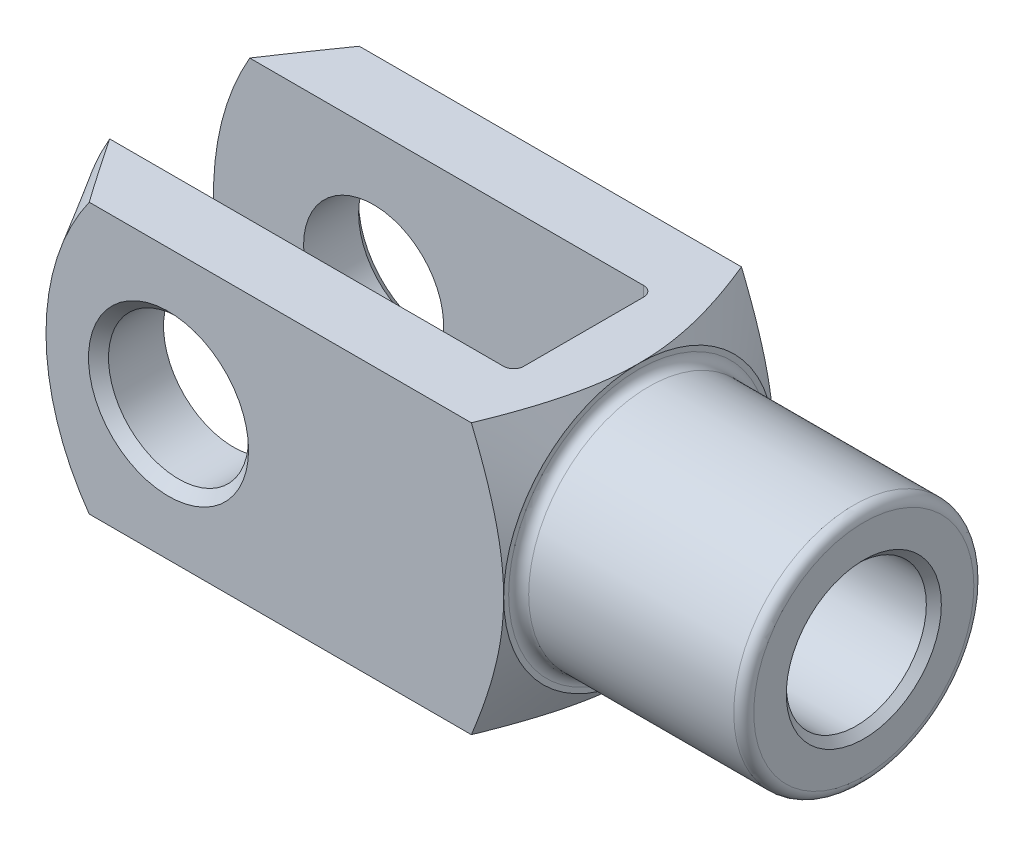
ISO-10303-21;
HEADER;
FILE_DESCRIPTION(('STEP AP214'),'2;1');
FILE_NAME('part.step','',(''),(''),'','','');
FILE_SCHEMA(('AUTOMOTIVE_DESIGN { 1 0 10303 214 1 1 1 1 }'));
ENDSEC;
DATA;
#1=APPLICATION_CONTEXT('core data for automotive mechanical design processes');
#2=APPLICATION_PROTOCOL_DEFINITION('international standard','automotive_design',2000,#1);
#3=PRODUCT_CONTEXT('',#1,'mechanical');
#4=PRODUCT('Part','Part','',(#3));
#5=PRODUCT_RELATED_PRODUCT_CATEGORY('part','',(#4));
#6=PRODUCT_DEFINITION_FORMATION('','',#4);
#7=PRODUCT_DEFINITION_CONTEXT('part definition',#1,'design');
#8=PRODUCT_DEFINITION('design','',#6,#7);
#9=PRODUCT_DEFINITION_SHAPE('','',#8);
#10=(LENGTH_UNIT() NAMED_UNIT(*) SI_UNIT(.MILLI.,.METRE.));
#11=(NAMED_UNIT(*) PLANE_ANGLE_UNIT() SI_UNIT($,.RADIAN.));
#12=(NAMED_UNIT(*) SI_UNIT($,.STERADIAN.) SOLID_ANGLE_UNIT());
#13=UNCERTAINTY_MEASURE_WITH_UNIT(LENGTH_MEASURE(1.E-05),#10,'distance_accuracy_value','');
#14=(GEOMETRIC_REPRESENTATION_CONTEXT(3) GLOBAL_UNCERTAINTY_ASSIGNED_CONTEXT((#13)) GLOBAL_UNIT_ASSIGNED_CONTEXT((#10,
#11,#12)) REPRESENTATION_CONTEXT('',''));
#15=CARTESIAN_POINT('',(0.,0.,0.));
#16=DIRECTION('',(0.,0.,1.));
#17=DIRECTION('',(1.,0.,0.));
#18=AXIS2_PLACEMENT_3D('',#15,#16,#17);
#19=CARTESIAN_POINT('',(-29.,-13.5,-5.99999999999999));
#20=DIRECTION('',(0.,-1.,0.));
#21=DIRECTION('',(0.,0.,-1.));
#22=AXIS2_PLACEMENT_3D('',#19,#20,#21);
#23=CYLINDRICAL_SURFACE('',#22,1.);
#24=DIRECTION('',(0.,1.,0.));
#25=VECTOR('',#24,1.);
#26=CARTESIAN_POINT('',(-28.,-13.5,-5.99999999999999));
#27=LINE('',#26,#25);
#28=CARTESIAN_POINT('',(-28.,-3.60555127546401,-5.99999999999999));
#29=VERTEX_POINT('',#28);
#30=CARTESIAN_POINT('',(-28.,-13.5,-5.99999999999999));
#31=VERTEX_POINT('',#30);
#32=EDGE_CURVE('E358',#29,#31,#27,.F.);
#33=ORIENTED_EDGE('',*,*,#32,.F.);
#34=CARTESIAN_POINT('',(-28.,-3.60555127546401,-5.99999999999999));
#35=CARTESIAN_POINT('',(-28.000007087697,-3.55494177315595,-6.03041382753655));
#36=CARTESIAN_POINT('',(-28.001386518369,-3.50396296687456,-6.06017529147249));
#37=CARTESIAN_POINT('',(-28.0065960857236,-3.40138529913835,-6.11833715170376));
#38=CARTESIAN_POINT('',(-28.0104251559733,-3.3497867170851,-6.14673813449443));
#39=CARTESIAN_POINT('',(-28.0251248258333,-3.19441978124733,-6.22972265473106));
#40=CARTESIAN_POINT('',(-28.0392107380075,-3.08983806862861,-6.28223313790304));
#41=CARTESIAN_POINT('',(-28.0740643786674,-2.87967288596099,-6.38129477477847));
#42=CARTESIAN_POINT('',(-28.0947990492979,-2.77409682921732,-6.42787385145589));
#43=CARTESIAN_POINT('',(-28.1416261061,-2.56173841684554,-6.51542025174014));
#44=CARTESIAN_POINT('',(-28.1677227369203,-2.45495516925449,-6.55638308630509));
#45=CARTESIAN_POINT('',(-28.2462471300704,-2.15662199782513,-6.66259073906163));
#46=CARTESIAN_POINT('',(-28.303304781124,-1.9640983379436,-6.72176788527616));
#47=CARTESIAN_POINT('',(-28.4262418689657,-1.57742895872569,-6.82288362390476));
#48=CARTESIAN_POINT('',(-28.4921270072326,-1.38328226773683,-6.86481100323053));
#49=CARTESIAN_POINT('',(-28.6980114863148,-0.798929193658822,-6.96548017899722));
#50=CARTESIAN_POINT('',(-28.8462392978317,-0.406811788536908,-6.99910832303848));
#51=CARTESIAN_POINT('',(-28.9960560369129,-0.0104348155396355,-6.99999416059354));
#52=CARTESIAN_POINT('',(-28.998028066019,-0.00521731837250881,-6.99999999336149));
#53=CARTESIAN_POINT('',(-29.,0.,-6.99999999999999));
#54=B_SPLINE_CURVE_WITH_KNOTS('',3,(#34,#35,#36,#37,#38,#39,#40,#41,#42,#43,#44,#45,#46,#47,#48,
#49,#50,#51,#52,#53),.UNSPECIFIED.,.F.,.F.,(4,2,2,2,2,2,2,2,2,4),(0.,0.177083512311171,
0.354089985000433,0.707258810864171,1.05869820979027,1.41041689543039,2.03723640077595,
2.66446272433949,3.91892182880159,3.93565503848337),.UNSPECIFIED.);
#55=CARTESIAN_POINT('',(-29.,0.,-6.99999999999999));
#56=VERTEX_POINT('',#55);
#57=EDGE_CURVE('E390',#29,#56,#54,.T.);
#58=ORIENTED_EDGE('',*,*,#57,.T.);
#59=DIRECTION('',(0.,1.,0.));
#60=VECTOR('',#59,1.);
#61=CARTESIAN_POINT('',(-29.,13.5,-6.99999999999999));
#62=LINE('',#61,#60);
#63=CARTESIAN_POINT('',(-29.,-13.5,-6.99999999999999));
#64=VERTEX_POINT('',#63);
#65=EDGE_CURVE('E183',#64,#56,#62,.T.);
#66=ORIENTED_EDGE('',*,*,#65,.F.);
#67=CARTESIAN_POINT('',(-29.,-13.5,-5.99999999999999));
#68=DIRECTION('',(0.,-1.,0.));
#69=DIRECTION('',(0.,0.,-1.));
#70=AXIS2_PLACEMENT_3D('',#67,#68,#69);
#71=CIRCLE('',#70,1.);
#72=EDGE_CURVE('E198',#31,#64,#71,.F.);
#73=ORIENTED_EDGE('',*,*,#72,.F.);
#74=EDGE_LOOP('',(#33,#58,#66,#73));
#75=FACE_BOUND('',#74,.T.);
#76=ADVANCED_FACE('F37',(#75),#23,.F.);
#77=CARTESIAN_POINT('',(-28.,-13.5,-6.99999999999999));
#78=DIRECTION('',(1.,0.,0.));
#79=DIRECTION('',(0.,0.,-1.));
#80=AXIS2_PLACEMENT_3D('',#77,#78,#79);
#81=PLANE('',#80);
#82=CARTESIAN_POINT('',(-28.,13.5,-5.99999999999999));
#83=VERTEX_POINT('',#82);
#84=CARTESIAN_POINT('',(-28.,3.60555127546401,-5.99999999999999));
#85=VERTEX_POINT('',#84);
#86=EDGE_CURVE('E374',#83,#85,#27,.F.);
#87=ORIENTED_EDGE('',*,*,#86,.T.);
#88=CARTESIAN_POINT('',(-28.,0.,0.));
#89=DIRECTION('',(1.,0.,0.));
#90=DIRECTION('',(0.,0.,-1.));
#91=AXIS2_PLACEMENT_3D('',#88,#89,#90);
#92=CIRCLE('',#91,7.);
#93=CARTESIAN_POINT('',(-28.,3.60555127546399,6.));
#94=VERTEX_POINT('',#93);
#95=EDGE_CURVE('E759',#85,#94,#92,.T.);
#96=ORIENTED_EDGE('',*,*,#95,.T.);
#97=DIRECTION('',(0.,1.,0.));
#98=VECTOR('',#97,1.);
#99=CARTESIAN_POINT('',(-28.,13.5,6.));
#100=LINE('',#99,#98);
#101=CARTESIAN_POINT('',(-28.,13.5,6.));
#102=VERTEX_POINT('',#101);
#103=EDGE_CURVE('E160',#94,#102,#100,.T.);
#104=ORIENTED_EDGE('',*,*,#103,.T.);
#105=DIRECTION('',(0.,0.,-1.));
#106=VECTOR('',#105,1.);
#107=CARTESIAN_POINT('',(-28.,13.5,-6.99999999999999));
#108=LINE('',#107,#106);
#109=EDGE_CURVE('E339',#102,#83,#108,.T.);
#110=ORIENTED_EDGE('',*,*,#109,.T.);
#111=EDGE_LOOP('',(#87,#96,#104,#110));
#112=FACE_BOUND('',#111,.T.);
#113=ADVANCED_FACE('F488',(#112),#81,.F.);
#114=CARTESIAN_POINT('',(-29.,-13.5,6.));
#115=DIRECTION('',(0.,-1.,0.));
#116=DIRECTION('',(0.,0.,-1.));
#117=AXIS2_PLACEMENT_3D('',#114,#115,#116);
#118=CYLINDRICAL_SURFACE('',#117,1.);
#119=ORIENTED_EDGE('',*,*,#103,.F.);
#120=CARTESIAN_POINT('',(-28.,3.60555127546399,6.));
#121=CARTESIAN_POINT('',(-28.000007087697,3.5549417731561,6.03041382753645));
#122=CARTESIAN_POINT('',(-28.001386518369,3.50396296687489,6.0601752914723));
#123=CARTESIAN_POINT('',(-28.0065960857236,3.40138529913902,6.11833715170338));
#124=CARTESIAN_POINT('',(-28.0104251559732,3.34978671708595,6.14673813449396));
#125=CARTESIAN_POINT('',(-28.0251248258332,3.19441978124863,6.22972265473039));
#126=CARTESIAN_POINT('',(-28.0392107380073,3.08983806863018,6.28223313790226));
#127=CARTESIAN_POINT('',(-28.0740643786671,2.87967288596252,6.38129477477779));
#128=CARTESIAN_POINT('',(-28.0947990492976,2.77409682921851,6.42787385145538));
#129=CARTESIAN_POINT('',(-28.1416261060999,2.56173841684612,6.51542025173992));
#130=CARTESIAN_POINT('',(-28.1677227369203,2.45495516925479,6.55638308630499));
#131=CARTESIAN_POINT('',(-28.2462471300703,2.15662199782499,6.66259073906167));
#132=CARTESIAN_POINT('',(-28.3033047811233,1.96409833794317,6.72176788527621));
#133=CARTESIAN_POINT('',(-28.4262418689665,1.57742895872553,6.82288362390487));
#134=CARTESIAN_POINT('',(-28.4921270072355,1.38328226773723,6.86481100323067));
#135=CARTESIAN_POINT('',(-28.6980114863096,0.798929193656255,6.96548017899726));
#136=CARTESIAN_POINT('',(-28.8462392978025,0.406811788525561,6.9991083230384));
#137=CARTESIAN_POINT('',(-28.9960560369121,0.0104348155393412,6.99999416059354));
#138=CARTESIAN_POINT('',(-28.9980280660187,0.00521731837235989,6.99999999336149));
#139=CARTESIAN_POINT('',(-29.,0.,7.));
#140=B_SPLINE_CURVE_WITH_KNOTS('',3,(#120,#121,#122,#123,#124,#125,#126,#127,#128,#129,#130,
#131,#132,#133,#134,#135,#136,#137,#138,#139),.UNSPECIFIED.,.F.,.F.,(4,2,2,2,2,2,2,2,2,4),(0.,
0.177083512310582,0.354089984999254,0.707258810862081,1.0586982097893,1.4104168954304,
2.03723640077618,2.66446272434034,3.91892182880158,3.93565503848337),.UNSPECIFIED.);
#141=CARTESIAN_POINT('',(-29.,0.,7.));
#142=VERTEX_POINT('',#141);
#143=EDGE_CURVE('E145',#94,#142,#140,.T.);
#144=ORIENTED_EDGE('',*,*,#143,.T.);
#145=DIRECTION('',(0.,1.,0.));
#146=VECTOR('',#145,1.);
#147=CARTESIAN_POINT('',(-29.,-13.5,7.));
#148=LINE('',#147,#146);
#149=CARTESIAN_POINT('',(-29.,13.5,7.));
#150=VERTEX_POINT('',#149);
#151=EDGE_CURVE('E159',#150,#142,#148,.F.);
#152=ORIENTED_EDGE('',*,*,#151,.F.);
#153=CARTESIAN_POINT('',(-29.,13.5,6.));
#154=DIRECTION('',(0.,1.,0.));
#155=DIRECTION('',(0.,0.,1.));
#156=AXIS2_PLACEMENT_3D('',#153,#154,#155);
#157=CIRCLE('',#156,1.);
#158=EDGE_CURVE('E190',#102,#150,#157,.F.);
#159=ORIENTED_EDGE('',*,*,#158,.F.);
#160=EDGE_LOOP('',(#119,#144,#152,#159));
#161=FACE_BOUND('',#160,.T.);
#162=ADVANCED_FACE('F156',(#161),#118,.F.);
#163=CARTESIAN_POINT('',(-72.,-13.5,-6.99999999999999));
#164=DIRECTION('',(0.,0.,-1.));
#165=DIRECTION('',(-1.,0.,0.));
#166=AXIS2_PLACEMENT_3D('',#163,#164,#165);
#167=PLANE('',#166);
#168=CARTESIAN_POINT('',(-56.,0.,-6.99999999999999));
#169=DIRECTION('',(0.,0.,-1.));
#170=DIRECTION('',(-1.,0.,0.));
#171=AXIS2_PLACEMENT_3D('',#168,#169,#170);
#172=CIRCLE('',#171,7.);
#173=CARTESIAN_POINT('',(-63.,0.,-6.99999999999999));
#174=VERTEX_POINT('',#173);
#175=EDGE_CURVE('E368',#174,#174,#172,.F.);
#176=ORIENTED_EDGE('',*,*,#175,.F.);
#177=EDGE_LOOP('',(#176));
#178=FACE_BOUND('',#177,.T.);
#179=CARTESIAN_POINT('',(-45.,0.,-6.99999999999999));
#180=DIRECTION('',(0.,0.,1.));
#181=DIRECTION('',(1.,0.,0.));
#182=AXIS2_PLACEMENT_3D('',#179,#180,#181);
#183=CIRCLE('',#182,27.);
#184=CARTESIAN_POINT('',(-68.3826859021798,13.5,-6.99999999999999));
#185=VERTEX_POINT('',#184);
#186=CARTESIAN_POINT('',(-68.3826859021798,-13.5,-6.99999999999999));
#187=VERTEX_POINT('',#186);
#188=EDGE_CURVE('E277',#185,#187,#183,.T.);
#189=ORIENTED_EDGE('',*,*,#188,.T.);
#190=DIRECTION('',(-1.,0.,0.));
#191=VECTOR('',#190,1.);
#192=CARTESIAN_POINT('',(-72.,-13.5,-6.99999999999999));
#193=LINE('',#192,#191);
#194=EDGE_CURVE('E334',#64,#187,#193,.T.);
#195=ORIENTED_EDGE('',*,*,#194,.F.);
#196=ORIENTED_EDGE('',*,*,#65,.T.);
#197=CARTESIAN_POINT('',(-29.,13.5,-6.99999999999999));
#198=VERTEX_POINT('',#197);
#199=EDGE_CURVE('E179',#56,#198,#62,.T.);
#200=ORIENTED_EDGE('',*,*,#199,.T.);
#201=DIRECTION('',(-1.,0.,0.));
#202=VECTOR('',#201,1.);
#203=CARTESIAN_POINT('',(-72.,13.5,-6.99999999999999));
#204=LINE('',#203,#202);
#205=EDGE_CURVE('E347',#198,#185,#204,.T.);
#206=ORIENTED_EDGE('',*,*,#205,.T.);
#207=EDGE_LOOP('',(#189,#195,#196,#200,#206));
#208=FACE_BOUND('',#207,.T.);
#209=ADVANCED_FACE('F393',(#178,#208),#167,.F.);
#210=CARTESIAN_POINT('',(-72.,-13.5,7.00000000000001));
#211=DIRECTION('',(0.,0.,1.));
#212=DIRECTION('',(1.,0.,0.));
#213=AXIS2_PLACEMENT_3D('',#210,#211,#212);
#214=PLANE('',#213);
#215=CARTESIAN_POINT('',(-56.,0.,7.00000000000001));
#216=DIRECTION('',(0.,0.,1.));
#217=DIRECTION('',(1.,0.,0.));
#218=AXIS2_PLACEMENT_3D('',#215,#216,#217);
#219=CIRCLE('',#218,7.);
#220=CARTESIAN_POINT('',(-49.,0.,7.));
#221=VERTEX_POINT('',#220);
#222=EDGE_CURVE('E346',#221,#221,#219,.F.);
#223=ORIENTED_EDGE('',*,*,#222,.F.);
#224=EDGE_LOOP('',(#223));
#225=FACE_BOUND('',#224,.T.);
#226=DIRECTION('',(1.,0.,0.));
#227=VECTOR('',#226,1.);
#228=CARTESIAN_POINT('',(-72.,-13.5,7.00000000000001));
#229=LINE('',#228,#227);
#230=CARTESIAN_POINT('',(-68.3826859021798,-13.5,7.00000000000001));
#231=VERTEX_POINT('',#230);
#232=CARTESIAN_POINT('',(-29.,-13.5,7.));
#233=VERTEX_POINT('',#232);
#234=EDGE_CURVE('E338',#231,#233,#229,.T.);
#235=ORIENTED_EDGE('',*,*,#234,.F.);
#236=CARTESIAN_POINT('',(-45.,0.,7.00000000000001));
#237=DIRECTION('',(0.,0.,1.));
#238=DIRECTION('',(1.,0.,0.));
#239=AXIS2_PLACEMENT_3D('',#236,#237,#238);
#240=CIRCLE('',#239,27.);
#241=CARTESIAN_POINT('',(-68.3826859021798,13.5,7.00000000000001));
#242=VERTEX_POINT('',#241);
#243=EDGE_CURVE('E444',#242,#231,#240,.T.);
#244=ORIENTED_EDGE('',*,*,#243,.F.);
#245=DIRECTION('',(1.,0.,0.));
#246=VECTOR('',#245,1.);
#247=CARTESIAN_POINT('',(-72.,13.5,7.00000000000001));
#248=LINE('',#247,#246);
#249=EDGE_CURVE('E176',#242,#150,#248,.T.);
#250=ORIENTED_EDGE('',*,*,#249,.T.);
#251=ORIENTED_EDGE('',*,*,#151,.T.);
#252=EDGE_CURVE('E164',#142,#233,#148,.F.);
#253=ORIENTED_EDGE('',*,*,#252,.T.);
#254=EDGE_LOOP('',(#235,#244,#250,#251,#253));
#255=FACE_BOUND('',#254,.T.);
#256=ADVANCED_FACE('F173',(#225,#255),#214,.F.);
#257=CARTESIAN_POINT('',(-72.,-13.5,13.5));
#258=DIRECTION('',(0.,0.,1.));
#259=DIRECTION('',(1.,0.,0.));
#260=AXIS2_PLACEMENT_3D('',#257,#258,#259);
#261=PLANE('',#260);
#262=CARTESIAN_POINT('',(-56.,0.,13.5));
#263=DIRECTION('',(0.,0.,1.));
#264=DIRECTION('',(1.,0.,0.));
#265=AXIS2_PLACEMENT_3D('',#262,#263,#264);
#266=CIRCLE('',#265,7.99999999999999);
#267=CARTESIAN_POINT('',(-48.,0.,13.5));
#268=VERTEX_POINT('',#267);
#269=EDGE_CURVE('E229',#268,#268,#266,.F.);
#270=ORIENTED_EDGE('',*,*,#269,.T.);
#271=EDGE_LOOP('',(#270));
#272=FACE_BOUND('',#271,.T.);
#273=DIRECTION('',(1.,0.,0.));
#274=VECTOR('',#273,1.);
#275=CARTESIAN_POINT('',(-72.,13.5,13.5));
#276=LINE('',#275,#274);
#277=CARTESIAN_POINT('',(-63.9257335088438,13.5,13.5));
#278=VERTEX_POINT('',#277);
#279=CARTESIAN_POINT('',(-25.7284752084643,13.5,13.5));
#280=VERTEX_POINT('',#279);
#281=EDGE_CURVE('E365',#278,#280,#276,.T.);
#282=ORIENTED_EDGE('',*,*,#281,.F.);
#283=CARTESIAN_POINT('',(-45.,0.,13.5));
#284=DIRECTION('',(0.,0.,1.));
#285=DIRECTION('',(1.,0.,0.));
#286=AXIS2_PLACEMENT_3D('',#283,#284,#285);
#287=CIRCLE('',#286,23.2472232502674);
#288=CARTESIAN_POINT('',(-63.9257335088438,-13.5,13.5));
#289=VERTEX_POINT('',#288);
#290=EDGE_CURVE('E61',#278,#289,#287,.T.);
#291=ORIENTED_EDGE('',*,*,#290,.T.);
#292=DIRECTION('',(1.,0.,0.));
#293=VECTOR('',#292,1.);
#294=CARTESIAN_POINT('',(-72.,-13.5,13.5));
#295=LINE('',#294,#293);
#296=CARTESIAN_POINT('',(-25.7284752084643,-13.5,13.5));
#297=VERTEX_POINT('',#296);
#298=EDGE_CURVE('E362',#289,#297,#295,.T.);
#299=ORIENTED_EDGE('',*,*,#298,.T.);
#300=CARTESIAN_POINT('',(-32.4304291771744,-27.5724587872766,13.5));
#301=CARTESIAN_POINT('',(-32.0854679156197,-26.9070980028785,13.5));
#302=CARTESIAN_POINT('',(-31.742330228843,-26.240782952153,13.5));
#303=CARTESIAN_POINT('',(-31.0606693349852,-24.9057532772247,13.5));
#304=CARTESIAN_POINT('',(-30.722146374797,-24.2370385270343,13.5));
#305=CARTESIAN_POINT('',(-30.0501346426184,-22.8956223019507,13.5));
#306=CARTESIAN_POINT('',(-29.7166556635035,-22.2229159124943,13.5));
#307=CARTESIAN_POINT('',(-29.0567154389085,-20.8740781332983,13.5));
#308=CARTESIAN_POINT('',(-28.7302540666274,-20.197946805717,13.5));
#309=CARTESIAN_POINT('',(-28.0663268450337,-18.7997650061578,13.5));
#310=CARTESIAN_POINT('',(-27.7294196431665,-18.0774486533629,13.5));
#311=CARTESIAN_POINT('',(-27.0684159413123,-16.6268968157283,13.5));
#312=CARTESIAN_POINT('',(-26.7443201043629,-15.8986610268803,13.5));
#313=CARTESIAN_POINT('',(-26.2709527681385,-14.8009827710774,13.5));
#314=CARTESIAN_POINT('',(-26.1153242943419,-14.4342798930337,13.5));
#315=CARTESIAN_POINT('',(-25.808971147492,-13.6988341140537,13.5));
#316=CARTESIAN_POINT('',(-25.6582463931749,-13.3300912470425,13.5));
#317=CARTESIAN_POINT('',(-25.3624766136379,-12.5903643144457,13.5));
#318=CARTESIAN_POINT('',(-25.217431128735,-12.2193804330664,13.5));
#319=CARTESIAN_POINT('',(-24.9339241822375,-11.4749116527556,13.5));
#320=CARTESIAN_POINT('',(-24.7954625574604,-11.101426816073,13.5));
#321=CARTESIAN_POINT('',(-24.4969840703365,-10.2704027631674,13.5));
#322=CARTESIAN_POINT('',(-24.3388043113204,-9.81219978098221,13.5));
#323=CARTESIAN_POINT('',(-24.0360567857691,-8.89133812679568,13.5));
#324=CARTESIAN_POINT('',(-23.8914878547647,-8.42867983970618,13.5));
#325=CARTESIAN_POINT('',(-23.6186454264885,-7.49855908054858,13.5));
#326=CARTESIAN_POINT('',(-23.4903715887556,-7.03109670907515,13.5));
#327=CARTESIAN_POINT('',(-23.253182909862,-6.09124666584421,13.5));
#328=CARTESIAN_POINT('',(-23.1442678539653,-5.61885904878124,13.5));
#329=CARTESIAN_POINT('',(-22.9513715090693,-4.68052707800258,13.5));
#330=CARTESIAN_POINT('',(-22.8668649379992,-4.21469177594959,13.5));
#331=CARTESIAN_POINT('',(-22.7224231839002,-3.2791949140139,13.5));
#332=CARTESIAN_POINT('',(-22.662487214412,-2.80953347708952,13.5));
#333=CARTESIAN_POINT('',(-22.5696920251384,-1.86781820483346,13.5));
#334=CARTESIAN_POINT('',(-22.5368151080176,-1.3957661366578,13.5));
#335=CARTESIAN_POINT('',(-22.4995884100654,-0.450533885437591,13.5));
#336=CARTESIAN_POINT('',(-22.4952376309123,0.0226462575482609,13.5));
#337=CARTESIAN_POINT('',(-22.5145298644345,0.933916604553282,13.5));
#338=CARTESIAN_POINT('',(-22.5361561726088,1.37205133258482,13.5));
#339=CARTESIAN_POINT('',(-22.6032147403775,2.24647569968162,13.5));
#340=CARTESIAN_POINT('',(-22.6486469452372,2.68276534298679,13.5));
#341=CARTESIAN_POINT('',(-22.7616517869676,3.55266413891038,13.5));
#342=CARTESIAN_POINT('',(-22.8292358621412,3.98627178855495,13.5));
#343=CARTESIAN_POINT('',(-22.9843161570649,4.84988834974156,13.5));
#344=CARTESIAN_POINT('',(-23.0718129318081,5.27989716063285,13.5));
#345=CARTESIAN_POINT('',(-23.2670701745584,6.14834375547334,13.5));
#346=CARTESIAN_POINT('',(-23.3753438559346,6.58666526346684,13.5));
#347=CARTESIAN_POINT('',(-23.6077854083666,7.45904439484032,13.5));
#348=CARTESIAN_POINT('',(-23.7319534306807,7.89310197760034,13.5));
#349=CARTESIAN_POINT('',(-23.9937810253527,8.75708887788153,13.5));
#350=CARTESIAN_POINT('',(-24.1314399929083,9.18701837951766,13.5));
#351=CARTESIAN_POINT('',(-24.3464699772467,9.82901563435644,13.5));
#352=CARTESIAN_POINT('',(-24.4195690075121,10.0425285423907,13.5));
#353=CARTESIAN_POINT('',(-24.568387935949,10.4686386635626,13.5));
#354=CARTESIAN_POINT('',(-24.6441078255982,10.6812358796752,13.5));
#355=CARTESIAN_POINT('',(-24.8874050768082,11.3522977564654,13.5));
#356=CARTESIAN_POINT('',(-25.0593999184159,11.809164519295,13.5));
#357=CARTESIAN_POINT('',(-25.4127281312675,12.7192834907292,13.5));
#358=CARTESIAN_POINT('',(-25.5940620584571,13.1725354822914,13.5));
#359=CARTESIAN_POINT('',(-25.9645603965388,14.0759400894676,13.5));
#360=CARTESIAN_POINT('',(-26.1537265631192,14.5260919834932,13.5));
#361=CARTESIAN_POINT('',(-26.5385867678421,15.4235797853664,13.5));
#362=CARTESIAN_POINT('',(-26.7342806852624,15.8709157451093,13.5));
#363=CARTESIAN_POINT('',(-27.1313434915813,16.7635184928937,13.5));
#364=CARTESIAN_POINT('',(-27.3327171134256,17.2087831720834,13.5));
#365=CARTESIAN_POINT('',(-27.7401463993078,18.0971674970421,13.5));
#366=CARTESIAN_POINT('',(-27.9462021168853,18.540287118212,13.5));
#367=CARTESIAN_POINT('',(-28.5702761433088,19.8667324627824,13.5));
#368=CARTESIAN_POINT('',(-28.994251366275,20.7472561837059,13.5));
#369=CARTESIAN_POINT('',(-29.8552271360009,22.5052140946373,13.5));
#370=CARTESIAN_POINT('',(-30.2922634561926,23.3826306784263,13.5));
#371=CARTESIAN_POINT('',(-31.175287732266,25.1329651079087,13.5));
#372=CARTESIAN_POINT('',(-31.6212758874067,26.0058828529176,13.5));
#373=CARTESIAN_POINT('',(-32.5199360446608,27.7477195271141,13.5));
#374=CARTESIAN_POINT('',(-32.9726046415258,28.6166402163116,13.5));
#375=CARTESIAN_POINT('',(-33.8833677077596,30.3516218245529,13.5));
#376=CARTESIAN_POINT('',(-34.3414621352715,31.2176827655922,13.5));
#377=CARTESIAN_POINT('',(-35.1936403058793,32.8190461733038,13.5));
#378=CARTESIAN_POINT('',(-35.587127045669,33.5546666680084,13.5));
#379=CARTESIAN_POINT('',(-36.3767395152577,35.0244904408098,13.5));
#380=CARTESIAN_POINT('',(-36.7728652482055,35.7586937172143,13.5));
#381=CARTESIAN_POINT('',(-37.9646720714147,37.959711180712,13.5));
#382=CARTESIAN_POINT('',(-38.7636731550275,39.4247275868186,13.5));
#383=CARTESIAN_POINT('',(-40.3635150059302,42.3428467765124,13.5));
#384=CARTESIAN_POINT('',(-41.1643190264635,43.7959697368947,13.5));
#385=CARTESIAN_POINT('',(-42.3690675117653,45.973543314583,13.5));
#386=CARTESIAN_POINT('',(-42.7712089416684,46.6989923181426,13.5));
#387=CARTESIAN_POINT('',(-43.5765516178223,48.1493007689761,13.5));
#388=CARTESIAN_POINT('',(-43.9797528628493,48.8741602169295,13.5));
#389=CARTESIAN_POINT('',(-44.3834136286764,49.5987636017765,13.5));
#390=B_SPLINE_CURVE_WITH_KNOTS('',3,(#300,#301,#302,#303,#304,#305,#306,#307,#308,#309,#310,
#311,#312,#313,#314,#315,#316,#317,#318,#319,#320,#321,#322,#323,#324,#325,#326,#327,#328,#329,
#330,#331,#332,#333,#334,#335,#336,#337,#338,#339,#340,#341,#342,#343,#344,#345,#346,#347,#348,
#349,#350,#351,#352,#353,#354,#355,#356,#357,#358,#359,#360,#361,#362,#363,#364,#365,#366,#367,
#368,#369,#370,#371,#372,#373,#374,#375,#376,#377,#378,#379,#380,#381,#382,#383,#384,#385,#386,
#387,#388,#389),.UNSPECIFIED.,.F.,.F.,(4,2,2,2,2,2,2,2,2,2,2,2,2,2,2,2,2,2,2,2,2,2,2,2,2,2,2,2,
2,2,2,2,2,2,2,2,2,2,2,2,2,2,2,2,4),(0.,2.24841482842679,4.49694948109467,6.7493996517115,
9.00180908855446,11.3927930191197,13.7839005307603,14.9789541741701,16.1739880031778,
17.3689249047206,18.5638321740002,20.0178658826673,21.4717750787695,22.9256538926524,
24.379516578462,25.7992511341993,27.2189402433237,28.6377000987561,30.0564103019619,
31.3717442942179,32.6870752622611,34.0030864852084,35.3191343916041,36.6732741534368,
38.0274268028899,39.3815187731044,40.0585434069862,40.7355658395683,42.1999363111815,
43.6643940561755,45.1291818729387,46.5939426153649,48.0599622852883,49.5259987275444,
52.4577049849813,55.3983502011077,58.3390609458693,61.2783212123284,64.2175588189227,
66.7202960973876,69.2230363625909,74.2292153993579,79.2067218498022,81.6950831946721,
84.1834416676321),.UNSPECIFIED.);
#391=CARTESIAN_POINT('',(-22.5,0.,13.5));
#392=VERTEX_POINT('',#391);
#393=EDGE_CURVE('E306',#392,#297,#390,.F.);
#394=ORIENTED_EDGE('',*,*,#393,.F.);
#395=EDGE_CURVE('E304',#280,#392,#390,.F.);
#396=ORIENTED_EDGE('',*,*,#395,.F.);
#397=EDGE_LOOP('',(#282,#291,#299,#394,#396));
#398=FACE_BOUND('',#397,.T.);
#399=ADVANCED_FACE('F288',(#272,#398),#261,.T.);
#400=CARTESIAN_POINT('',(-72.,-13.5,13.5));
#401=DIRECTION('',(0.,-1.,0.));
#402=DIRECTION('',(0.,0.,-1.));
#403=AXIS2_PLACEMENT_3D('',#400,#401,#402);
#404=PLANE('',#403);
#405=ORIENTED_EDGE('',*,*,#194,.T.);
#406=CARTESIAN_POINT('',(-85.3353783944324,-13.5,19.9067277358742));
#407=CARTESIAN_POINT('',(-84.5897429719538,-13.5,18.6820817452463));
#408=CARTESIAN_POINT('',(-83.8426357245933,-13.5,17.4583291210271));
#409=CARTESIAN_POINT('',(-82.3448194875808,-13.5,15.0130165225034));
#410=CARTESIAN_POINT('',(-81.59411046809,-13.5,13.7914565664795));
#411=CARTESIAN_POINT('',(-80.0883557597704,-13.5,11.350810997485));
#412=CARTESIAN_POINT('',(-79.3333095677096,-13.5,10.1317256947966));
#413=CARTESIAN_POINT('',(-77.8180938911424,-13.5,7.69674639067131));
#414=CARTESIAN_POINT('',(-77.0579244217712,-13.5,6.48085237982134));
#415=CARTESIAN_POINT('',(-75.5330177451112,-13.5,4.05566502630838));
#416=CARTESIAN_POINT('',(-74.7682942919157,-13.5,2.84636304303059));
#417=CARTESIAN_POINT('',(-73.2311470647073,-13.5,0.432665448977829));
#418=CARTESIAN_POINT('',(-72.4587233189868,-13.5,-0.771730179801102));
#419=CARTESIAN_POINT('',(-70.9041541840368,-13.5,-3.17431337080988));
#420=CARTESIAN_POINT('',(-70.1220084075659,-13.5,-4.37250068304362));
#421=CARTESIAN_POINT('',(-68.9394271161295,-13.5,-6.16359189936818));
#422=CARTESIAN_POINT('',(-68.5436743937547,-13.5,-6.75958848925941));
#423=CARTESIAN_POINT('',(-67.7485806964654,-13.5,-7.94918226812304));
#424=CARTESIAN_POINT('',(-67.3492397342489,-13.5,-8.5427794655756));
#425=CARTESIAN_POINT('',(-66.5457822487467,-13.5,-9.72812510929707));
#426=CARTESIAN_POINT('',(-66.1416590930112,-13.5,-10.319869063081));
#427=CARTESIAN_POINT('',(-65.328600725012,-13.5,-11.500038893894));
#428=CARTESIAN_POINT('',(-64.9196655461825,-13.5,-12.0884647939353));
#429=CARTESIAN_POINT('',(-64.096256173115,-13.5,-13.2612199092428));
#430=CARTESIAN_POINT('',(-63.6817833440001,-13.5,-13.845550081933));
#431=CARTESIAN_POINT('',(-62.8461635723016,-13.5,-15.0094493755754));
#432=CARTESIAN_POINT('',(-62.4250164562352,-13.5,-15.5890183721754));
#433=CARTESIAN_POINT('',(-61.5742466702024,-13.5,-16.7429906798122));
#434=CARTESIAN_POINT('',(-61.1446143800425,-13.5,-17.3173869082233));
#435=CARTESIAN_POINT('',(-60.2757290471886,-13.5,-18.4588171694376));
#436=CARTESIAN_POINT('',(-59.8364767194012,-13.5,-19.0258517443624));
#437=CARTESIAN_POINT('',(-59.1685494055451,-13.5,-19.869590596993));
#438=CARTESIAN_POINT('',(-58.9443098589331,-13.5,-20.1498090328));
#439=CARTESIAN_POINT('',(-58.4925201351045,-13.5,-20.7075596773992));
#440=CARTESIAN_POINT('',(-58.2649700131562,-13.5,-20.9850919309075));
#441=CARTESIAN_POINT('',(-57.8061154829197,-13.5,-21.5371561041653));
#442=CARTESIAN_POINT('',(-57.5748101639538,-13.5,-21.811687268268));
#443=CARTESIAN_POINT('',(-57.108015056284,-13.5,-22.3571941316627));
#444=CARTESIAN_POINT('',(-56.8725250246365,-13.5,-22.628169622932));
#445=CARTESIAN_POINT('',(-56.6347136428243,-13.5,-22.8971084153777));
#446=B_SPLINE_CURVE_WITH_KNOTS('',3,(#406,#407,#408,#409,#410,#411,#412,#413,#414,#415,#416,
#417,#418,#419,#420,#421,#422,#423,#424,#425,#426,#427,#428,#429,#430,#431,#432,#433,#434,#435,
#436,#437,#438,#439,#440,#441,#442,#443,#444,#445),.UNSPECIFIED.,.F.,.F.,(4,2,2,2,2,2,2,2,2,2,2,
2,2,2,2,2,2,2,2,4),(0.,4.30134760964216,8.60273091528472,12.904623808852,17.2065039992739,
21.4989060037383,25.7912922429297,30.0838500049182,32.2301130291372,34.376368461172,
36.5260664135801,38.6757494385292,40.8249119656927,42.9741304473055,45.1259441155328,
47.2775984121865,48.3542633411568,49.4309103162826,50.5078224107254,51.5847972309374),.UNSPECIFIED.);
#447=CARTESIAN_POINT('',(-63.9257335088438,-13.5,-13.5));
#448=VERTEX_POINT('',#447);
#449=EDGE_CURVE('E276',#187,#448,#446,.T.);
#450=ORIENTED_EDGE('',*,*,#449,.T.);
#451=DIRECTION('',(1.,0.,0.));
#452=VECTOR('',#451,1.);
#453=CARTESIAN_POINT('',(-72.,-13.5,-13.5));
#454=LINE('',#453,#452);
#455=CARTESIAN_POINT('',(-25.7284752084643,-13.5,-13.5));
#456=VERTEX_POINT('',#455);
#457=EDGE_CURVE('E359',#448,#456,#454,.T.);
#458=ORIENTED_EDGE('',*,*,#457,.T.);
#459=CARTESIAN_POINT('',(-32.4304291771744,-13.5,-27.5724587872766));
#460=CARTESIAN_POINT('',(-32.0854679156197,-13.5,-26.9070980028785));
#461=CARTESIAN_POINT('',(-31.742330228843,-13.5,-26.240782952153));
#462=CARTESIAN_POINT('',(-31.0606693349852,-13.5,-24.9057532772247));
#463=CARTESIAN_POINT('',(-30.722146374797,-13.5,-24.2370385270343));
#464=CARTESIAN_POINT('',(-30.0501346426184,-13.5,-22.8956223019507));
#465=CARTESIAN_POINT('',(-29.7166556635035,-13.5,-22.2229159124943));
#466=CARTESIAN_POINT('',(-29.0567154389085,-13.5,-20.8740781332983));
#467=CARTESIAN_POINT('',(-28.7302540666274,-13.5,-20.197946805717));
#468=CARTESIAN_POINT('',(-28.0663268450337,-13.5,-18.7997650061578));
#469=CARTESIAN_POINT('',(-27.7294196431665,-13.5,-18.0774486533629));
#470=CARTESIAN_POINT('',(-27.0684159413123,-13.5,-16.6268968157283));
#471=CARTESIAN_POINT('',(-26.7443201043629,-13.5,-15.8986610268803));
#472=CARTESIAN_POINT('',(-26.2709527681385,-13.5,-14.8009827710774));
#473=CARTESIAN_POINT('',(-26.1153242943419,-13.5,-14.4342798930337));
#474=CARTESIAN_POINT('',(-25.808971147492,-13.5,-13.6988341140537));
#475=CARTESIAN_POINT('',(-25.6582463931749,-13.5,-13.3300912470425));
#476=CARTESIAN_POINT('',(-25.3624766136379,-13.5,-12.5903643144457));
#477=CARTESIAN_POINT('',(-25.217431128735,-13.5,-12.2193804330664));
#478=CARTESIAN_POINT('',(-24.9339241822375,-13.5,-11.4749116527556));
#479=CARTESIAN_POINT('',(-24.7954625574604,-13.5,-11.101426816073));
#480=CARTESIAN_POINT('',(-24.4969840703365,-13.5,-10.2704027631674));
#481=CARTESIAN_POINT('',(-24.3388043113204,-13.5,-9.81219978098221));
#482=CARTESIAN_POINT('',(-24.0360567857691,-13.5,-8.89133812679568));
#483=CARTESIAN_POINT('',(-23.8914878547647,-13.5,-8.42867983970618));
#484=CARTESIAN_POINT('',(-23.6186454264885,-13.5,-7.49855908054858));
#485=CARTESIAN_POINT('',(-23.4903715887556,-13.5,-7.03109670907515));
#486=CARTESIAN_POINT('',(-23.253182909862,-13.5,-6.09124666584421));
#487=CARTESIAN_POINT('',(-23.1442678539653,-13.5,-5.61885904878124));
#488=CARTESIAN_POINT('',(-22.9513715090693,-13.5,-4.68052707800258));
#489=CARTESIAN_POINT('',(-22.8668649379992,-13.5,-4.21469177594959));
#490=CARTESIAN_POINT('',(-22.7224231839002,-13.5,-3.2791949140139));
#491=CARTESIAN_POINT('',(-22.662487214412,-13.5,-2.80953347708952));
#492=CARTESIAN_POINT('',(-22.5696920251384,-13.5,-1.86781820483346));
#493=CARTESIAN_POINT('',(-22.5368151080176,-13.5,-1.3957661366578));
#494=CARTESIAN_POINT('',(-22.4995884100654,-13.5,-0.450533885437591));
#495=CARTESIAN_POINT('',(-22.4952376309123,-13.5,0.0226462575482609));
#496=CARTESIAN_POINT('',(-22.5145298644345,-13.5,0.933916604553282));
#497=CARTESIAN_POINT('',(-22.5361561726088,-13.5,1.37205133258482));
#498=CARTESIAN_POINT('',(-22.6032147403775,-13.5,2.24647569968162));
#499=CARTESIAN_POINT('',(-22.6486469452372,-13.5,2.68276534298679));
#500=CARTESIAN_POINT('',(-22.7616517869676,-13.5,3.55266413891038));
#501=CARTESIAN_POINT('',(-22.8292358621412,-13.5,3.98627178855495));
#502=CARTESIAN_POINT('',(-22.9843161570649,-13.5,4.84988834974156));
#503=CARTESIAN_POINT('',(-23.0718129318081,-13.5,5.27989716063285));
#504=CARTESIAN_POINT('',(-23.2670701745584,-13.5,6.14834375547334));
#505=CARTESIAN_POINT('',(-23.3753438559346,-13.5,6.58666526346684));
#506=CARTESIAN_POINT('',(-23.6077854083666,-13.5,7.45904439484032));
#507=CARTESIAN_POINT('',(-23.7319534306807,-13.5,7.89310197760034));
#508=CARTESIAN_POINT('',(-23.9937810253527,-13.5,8.75708887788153));
#509=CARTESIAN_POINT('',(-24.1314399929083,-13.5,9.18701837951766));
#510=CARTESIAN_POINT('',(-24.3464699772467,-13.5,9.82901563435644));
#511=CARTESIAN_POINT('',(-24.4195690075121,-13.5,10.0425285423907));
#512=CARTESIAN_POINT('',(-24.568387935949,-13.5,10.4686386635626));
#513=CARTESIAN_POINT('',(-24.6441078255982,-13.5,10.6812358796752));
#514=CARTESIAN_POINT('',(-24.8874050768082,-13.5,11.3522977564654));
#515=CARTESIAN_POINT('',(-25.0593999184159,-13.5,11.809164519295));
#516=CARTESIAN_POINT('',(-25.4127281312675,-13.5,12.7192834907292));
#517=CARTESIAN_POINT('',(-25.5940620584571,-13.5,13.1725354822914));
#518=CARTESIAN_POINT('',(-25.9645603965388,-13.5,14.0759400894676));
#519=CARTESIAN_POINT('',(-26.1537265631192,-13.5,14.5260919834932));
#520=CARTESIAN_POINT('',(-26.5385867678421,-13.5,15.4235797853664));
#521=CARTESIAN_POINT('',(-26.7342806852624,-13.5,15.8709157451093));
#522=CARTESIAN_POINT('',(-27.1313434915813,-13.5,16.7635184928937));
#523=CARTESIAN_POINT('',(-27.3327171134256,-13.5,17.2087831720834));
#524=CARTESIAN_POINT('',(-27.7401463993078,-13.5,18.0971674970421));
#525=CARTESIAN_POINT('',(-27.9462021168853,-13.5,18.540287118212));
#526=CARTESIAN_POINT('',(-28.5702761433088,-13.5,19.8667324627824));
#527=CARTESIAN_POINT('',(-28.994251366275,-13.5,20.7472561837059));
#528=CARTESIAN_POINT('',(-29.8552271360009,-13.5,22.5052140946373));
#529=CARTESIAN_POINT('',(-30.2922634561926,-13.5,23.3826306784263));
#530=CARTESIAN_POINT('',(-31.175287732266,-13.5,25.1329651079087));
#531=CARTESIAN_POINT('',(-31.6212758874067,-13.5,26.0058828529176));
#532=CARTESIAN_POINT('',(-32.5199360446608,-13.5,27.7477195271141));
#533=CARTESIAN_POINT('',(-32.9726046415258,-13.5,28.6166402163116));
#534=CARTESIAN_POINT('',(-33.8833677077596,-13.5,30.3516218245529));
#535=CARTESIAN_POINT('',(-34.3414621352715,-13.5,31.2176827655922));
#536=CARTESIAN_POINT('',(-35.1936403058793,-13.5,32.8190461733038));
#537=CARTESIAN_POINT('',(-35.587127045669,-13.5,33.5546666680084));
#538=CARTESIAN_POINT('',(-36.3767395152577,-13.5,35.0244904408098));
#539=CARTESIAN_POINT('',(-36.7728652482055,-13.5,35.7586937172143));
#540=CARTESIAN_POINT('',(-37.9646720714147,-13.5,37.959711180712));
#541=CARTESIAN_POINT('',(-38.7636731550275,-13.5,39.4247275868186));
#542=CARTESIAN_POINT('',(-40.3635150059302,-13.5,42.3428467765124));
#543=CARTESIAN_POINT('',(-41.1643190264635,-13.5,43.7959697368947));
#544=CARTESIAN_POINT('',(-42.3690675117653,-13.5,45.973543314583));
#545=CARTESIAN_POINT('',(-42.7712089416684,-13.5,46.6989923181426));
#546=CARTESIAN_POINT('',(-43.5765516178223,-13.5,48.1493007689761));
#547=CARTESIAN_POINT('',(-43.9797528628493,-13.5,48.8741602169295));
#548=CARTESIAN_POINT('',(-44.3834136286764,-13.5,49.5987636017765));
#549=B_SPLINE_CURVE_WITH_KNOTS('',3,(#459,#460,#461,#462,#463,#464,#465,#466,#467,#468,#469,
#470,#471,#472,#473,#474,#475,#476,#477,#478,#479,#480,#481,#482,#483,#484,#485,#486,#487,#488,
#489,#490,#491,#492,#493,#494,#495,#496,#497,#498,#499,#500,#501,#502,#503,#504,#505,#506,#507,
#508,#509,#510,#511,#512,#513,#514,#515,#516,#517,#518,#519,#520,#521,#522,#523,#524,#525,#526,
#527,#528,#529,#530,#531,#532,#533,#534,#535,#536,#537,#538,#539,#540,#541,#542,#543,#544,#545,
#546,#547,#548),.UNSPECIFIED.,.F.,.F.,(4,2,2,2,2,2,2,2,2,2,2,2,2,2,2,2,2,2,2,2,2,2,2,2,2,2,2,2,
2,2,2,2,2,2,2,2,2,2,2,2,2,2,2,2,4),(0.,2.24841482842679,4.49694948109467,6.7493996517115,
9.00180908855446,11.3927930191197,13.7839005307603,14.9789541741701,16.1739880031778,
17.3689249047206,18.5638321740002,20.0178658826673,21.4717750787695,22.9256538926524,
24.379516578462,25.7992511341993,27.2189402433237,28.6377000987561,30.0564103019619,
31.3717442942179,32.6870752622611,34.0030864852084,35.3191343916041,36.6732741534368,
38.0274268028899,39.3815187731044,40.0585434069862,40.7355658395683,42.1999363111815,
43.6643940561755,45.1291818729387,46.5939426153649,48.0599622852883,49.5259987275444,
52.4577049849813,55.3983502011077,58.3390609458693,61.2783212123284,64.2175588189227,
66.7202960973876,69.2230363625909,74.2292153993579,79.2067218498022,81.6950831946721,
84.1834416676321),.UNSPECIFIED.);
#550=CARTESIAN_POINT('',(-22.5,-13.5,0.));
#551=VERTEX_POINT('',#550);
#552=EDGE_CURVE('E305',#551,#456,#549,.F.);
#553=ORIENTED_EDGE('',*,*,#552,.F.);
#554=EDGE_CURVE('E296',#297,#551,#549,.F.);
#555=ORIENTED_EDGE('',*,*,#554,.F.);
#556=ORIENTED_EDGE('',*,*,#298,.F.);
#557=CARTESIAN_POINT('',(-56.6347136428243,-13.5,22.8971084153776));
#558=CARTESIAN_POINT('',(-56.8725250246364,-13.5,22.6281696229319));
#559=CARTESIAN_POINT('',(-57.108015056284,-13.5,22.3571941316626));
#560=CARTESIAN_POINT('',(-57.5748101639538,-13.5,21.8116872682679));
#561=CARTESIAN_POINT('',(-57.8061154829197,-13.5,21.5371561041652));
#562=CARTESIAN_POINT('',(-58.2649700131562,-13.5,20.9850919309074));
#563=CARTESIAN_POINT('',(-58.4925201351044,-13.5,20.7075596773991));
#564=CARTESIAN_POINT('',(-58.9443098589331,-13.5,20.1498090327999));
#565=CARTESIAN_POINT('',(-59.168549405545,-13.5,19.869590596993));
#566=CARTESIAN_POINT('',(-59.8364767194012,-13.5,19.0258517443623));
#567=CARTESIAN_POINT('',(-60.2757290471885,-13.5,18.4588171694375));
#568=CARTESIAN_POINT('',(-61.1446143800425,-13.5,17.3173869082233));
#569=CARTESIAN_POINT('',(-61.5742466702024,-13.5,16.7429906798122));
#570=CARTESIAN_POINT('',(-62.4250164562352,-13.5,15.5890183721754));
#571=CARTESIAN_POINT('',(-62.8461635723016,-13.5,15.0094493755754));
#572=CARTESIAN_POINT('',(-63.6817833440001,-13.5,13.8455500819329));
#573=CARTESIAN_POINT('',(-64.096256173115,-13.5,13.2612199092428));
#574=CARTESIAN_POINT('',(-64.9196655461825,-13.5,12.0884647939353));
#575=CARTESIAN_POINT('',(-65.328600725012,-13.5,11.500038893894));
#576=CARTESIAN_POINT('',(-66.1416590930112,-13.5,10.319869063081));
#577=CARTESIAN_POINT('',(-66.5457822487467,-13.5,9.72812510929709));
#578=CARTESIAN_POINT('',(-67.3492397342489,-13.5,8.54277946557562));
#579=CARTESIAN_POINT('',(-67.7485806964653,-13.5,7.94918226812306));
#580=CARTESIAN_POINT('',(-68.5436743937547,-13.5,6.75958848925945));
#581=CARTESIAN_POINT('',(-68.9394271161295,-13.5,6.16359189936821));
#582=CARTESIAN_POINT('',(-70.1220084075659,-13.5,4.37250068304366));
#583=CARTESIAN_POINT('',(-70.9041541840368,-13.5,3.17431337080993));
#584=CARTESIAN_POINT('',(-72.4587233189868,-13.5,0.771730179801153));
#585=CARTESIAN_POINT('',(-73.2311470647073,-13.5,-0.432665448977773));
#586=CARTESIAN_POINT('',(-74.7682942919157,-13.5,-2.84636304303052));
#587=CARTESIAN_POINT('',(-75.5330177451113,-13.5,-4.05566502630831));
#588=CARTESIAN_POINT('',(-77.0579244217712,-13.5,-6.48085237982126));
#589=CARTESIAN_POINT('',(-77.8180938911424,-13.5,-7.69674639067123));
#590=CARTESIAN_POINT('',(-79.3333095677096,-13.5,-10.1317256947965));
#591=CARTESIAN_POINT('',(-80.0883557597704,-13.5,-11.3508109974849));
#592=CARTESIAN_POINT('',(-81.5941104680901,-13.5,-13.7914565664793));
#593=CARTESIAN_POINT('',(-82.3448194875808,-13.5,-15.0130165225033));
#594=CARTESIAN_POINT('',(-83.8426357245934,-13.5,-17.458329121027));
#595=CARTESIAN_POINT('',(-84.5897429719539,-13.5,-18.6820817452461));
#596=CARTESIAN_POINT('',(-85.3353783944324,-13.5,-19.9067277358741));
#597=B_SPLINE_CURVE_WITH_KNOTS('',3,(#557,#558,#559,#560,#561,#562,#563,#564,#565,#566,#567,
#568,#569,#570,#571,#572,#573,#574,#575,#576,#577,#578,#579,#580,#581,#582,#583,#584,#585,#586,
#587,#588,#589,#590,#591,#592,#593,#594,#595,#596),.UNSPECIFIED.,.F.,.F.,(4,2,2,2,2,2,2,2,2,2,2,
2,2,2,2,2,2,2,2,4),(0.,1.07697482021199,2.15388691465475,3.23053388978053,4.3071988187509,
6.45885311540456,8.61066678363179,10.7598852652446,12.9090477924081,15.0587308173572,
17.2084287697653,19.3546842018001,21.5009472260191,25.7935049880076,30.085891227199,
34.3782932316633,38.6801734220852,42.9820663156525,47.2834496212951,51.5847972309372),.UNSPECIFIED.);
#598=EDGE_CURVE('E267',#289,#231,#597,.T.);
#599=ORIENTED_EDGE('',*,*,#598,.T.);
#600=ORIENTED_EDGE('',*,*,#234,.T.);
#601=CARTESIAN_POINT('',(-29.,-13.5,6.));
#602=DIRECTION('',(0.,-1.,0.));
#603=DIRECTION('',(0.,0.,-1.));
#604=AXIS2_PLACEMENT_3D('',#601,#602,#603);
#605=CIRCLE('',#604,1.);
#606=CARTESIAN_POINT('',(-28.,-13.5,6.));
#607=VERTEX_POINT('',#606);
#608=EDGE_CURVE('E166',#233,#607,#605,.F.);
#609=ORIENTED_EDGE('',*,*,#608,.T.);
#610=DIRECTION('',(0.,0.,-1.));
#611=VECTOR('',#610,1.);
#612=CARTESIAN_POINT('',(-28.,-13.5,-6.99999999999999));
#613=LINE('',#612,#611);
#614=EDGE_CURVE('E342',#607,#31,#613,.T.);
#615=ORIENTED_EDGE('',*,*,#614,.T.);
#616=ORIENTED_EDGE('',*,*,#72,.T.);
#617=EDGE_LOOP('',(#405,#450,#458,#553,#555,#556,#599,#600,#609,#615,#616));
#618=FACE_BOUND('',#617,.T.);
#619=ADVANCED_FACE('F283',(#618),#404,.T.);
#620=CARTESIAN_POINT('',(-72.,-13.5,-13.5));
#621=DIRECTION('',(0.,0.,-1.));
#622=DIRECTION('',(-1.,0.,0.));
#623=AXIS2_PLACEMENT_3D('',#620,#621,#622);
#624=PLANE('',#623);
#625=CARTESIAN_POINT('',(-56.,0.,-13.5));
#626=DIRECTION('',(0.,0.,-1.));
#627=DIRECTION('',(-1.,0.,0.));
#628=AXIS2_PLACEMENT_3D('',#625,#626,#627);
#629=CIRCLE('',#628,7.99999999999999);
#630=CARTESIAN_POINT('',(-64.,0.,-13.5));
#631=VERTEX_POINT('',#630);
#632=EDGE_CURVE('E217',#631,#631,#629,.F.);
#633=ORIENTED_EDGE('',*,*,#632,.T.);
#634=EDGE_LOOP('',(#633));
#635=FACE_BOUND('',#634,.T.);
#636=ORIENTED_EDGE('',*,*,#457,.F.);
#637=CARTESIAN_POINT('',(-45.,0.,-13.5));
#638=DIRECTION('',(0.,0.,1.));
#639=DIRECTION('',(1.,0.,0.));
#640=AXIS2_PLACEMENT_3D('',#637,#638,#639);
#641=CIRCLE('',#640,23.2472232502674);
#642=CARTESIAN_POINT('',(-63.9257335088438,13.5,-13.5));
#643=VERTEX_POINT('',#642);
#644=EDGE_CURVE('E406',#643,#448,#641,.T.);
#645=ORIENTED_EDGE('',*,*,#644,.F.);
#646=DIRECTION('',(1.,0.,0.));
#647=VECTOR('',#646,1.);
#648=CARTESIAN_POINT('',(-72.,13.5,-13.5));
#649=LINE('',#648,#647);
#650=CARTESIAN_POINT('',(-25.7284752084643,13.5,-13.5));
#651=VERTEX_POINT('',#650);
#652=EDGE_CURVE('E356',#643,#651,#649,.T.);
#653=ORIENTED_EDGE('',*,*,#652,.T.);
#654=CARTESIAN_POINT('',(-32.4304291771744,-27.5724587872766,-13.5));
#655=CARTESIAN_POINT('',(-32.0854679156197,-26.9070980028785,-13.5));
#656=CARTESIAN_POINT('',(-31.742330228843,-26.240782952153,-13.5));
#657=CARTESIAN_POINT('',(-31.0606693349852,-24.9057532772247,-13.5));
#658=CARTESIAN_POINT('',(-30.722146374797,-24.2370385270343,-13.5));
#659=CARTESIAN_POINT('',(-30.0501346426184,-22.8956223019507,-13.5));
#660=CARTESIAN_POINT('',(-29.7166556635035,-22.2229159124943,-13.5));
#661=CARTESIAN_POINT('',(-29.0567154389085,-20.8740781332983,-13.5));
#662=CARTESIAN_POINT('',(-28.7302540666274,-20.197946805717,-13.5));
#663=CARTESIAN_POINT('',(-28.0663268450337,-18.7997650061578,-13.5));
#664=CARTESIAN_POINT('',(-27.7294196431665,-18.0774486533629,-13.5));
#665=CARTESIAN_POINT('',(-27.0684159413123,-16.6268968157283,-13.5));
#666=CARTESIAN_POINT('',(-26.7443201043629,-15.8986610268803,-13.5));
#667=CARTESIAN_POINT('',(-26.2709527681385,-14.8009827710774,-13.5));
#668=CARTESIAN_POINT('',(-26.1153242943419,-14.4342798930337,-13.5));
#669=CARTESIAN_POINT('',(-25.808971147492,-13.6988341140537,-13.5));
#670=CARTESIAN_POINT('',(-25.6582463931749,-13.3300912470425,-13.5));
#671=CARTESIAN_POINT('',(-25.3624766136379,-12.5903643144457,-13.5));
#672=CARTESIAN_POINT('',(-25.217431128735,-12.2193804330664,-13.5));
#673=CARTESIAN_POINT('',(-24.9339241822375,-11.4749116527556,-13.5));
#674=CARTESIAN_POINT('',(-24.7954625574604,-11.101426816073,-13.5));
#675=CARTESIAN_POINT('',(-24.4969840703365,-10.2704027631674,-13.5));
#676=CARTESIAN_POINT('',(-24.3388043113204,-9.81219978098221,-13.5));
#677=CARTESIAN_POINT('',(-24.0360567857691,-8.89133812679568,-13.5));
#678=CARTESIAN_POINT('',(-23.8914878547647,-8.42867983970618,-13.5));
#679=CARTESIAN_POINT('',(-23.6186454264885,-7.49855908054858,-13.5));
#680=CARTESIAN_POINT('',(-23.4903715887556,-7.03109670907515,-13.5));
#681=CARTESIAN_POINT('',(-23.253182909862,-6.09124666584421,-13.5));
#682=CARTESIAN_POINT('',(-23.1442678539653,-5.61885904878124,-13.5));
#683=CARTESIAN_POINT('',(-22.9513715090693,-4.68052707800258,-13.5));
#684=CARTESIAN_POINT('',(-22.8668649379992,-4.21469177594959,-13.5));
#685=CARTESIAN_POINT('',(-22.7224231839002,-3.2791949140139,-13.5));
#686=CARTESIAN_POINT('',(-22.662487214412,-2.80953347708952,-13.5));
#687=CARTESIAN_POINT('',(-22.5696920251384,-1.86781820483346,-13.5));
#688=CARTESIAN_POINT('',(-22.5368151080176,-1.3957661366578,-13.5));
#689=CARTESIAN_POINT('',(-22.4995884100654,-0.450533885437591,-13.5));
#690=CARTESIAN_POINT('',(-22.4952376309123,0.0226462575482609,-13.5));
#691=CARTESIAN_POINT('',(-22.5145298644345,0.933916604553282,-13.5));
#692=CARTESIAN_POINT('',(-22.5361561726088,1.37205133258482,-13.5));
#693=CARTESIAN_POINT('',(-22.6032147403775,2.24647569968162,-13.5));
#694=CARTESIAN_POINT('',(-22.6486469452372,2.68276534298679,-13.5));
#695=CARTESIAN_POINT('',(-22.7616517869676,3.55266413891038,-13.5));
#696=CARTESIAN_POINT('',(-22.8292358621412,3.98627178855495,-13.5));
#697=CARTESIAN_POINT('',(-22.9843161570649,4.84988834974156,-13.5));
#698=CARTESIAN_POINT('',(-23.0718129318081,5.27989716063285,-13.5));
#699=CARTESIAN_POINT('',(-23.2670701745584,6.14834375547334,-13.5));
#700=CARTESIAN_POINT('',(-23.3753438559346,6.58666526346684,-13.5));
#701=CARTESIAN_POINT('',(-23.6077854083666,7.45904439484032,-13.5));
#702=CARTESIAN_POINT('',(-23.7319534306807,7.89310197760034,-13.5));
#703=CARTESIAN_POINT('',(-23.9937810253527,8.75708887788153,-13.5));
#704=CARTESIAN_POINT('',(-24.1314399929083,9.18701837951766,-13.5));
#705=CARTESIAN_POINT('',(-24.3464699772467,9.82901563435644,-13.5));
#706=CARTESIAN_POINT('',(-24.4195690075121,10.0425285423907,-13.5));
#707=CARTESIAN_POINT('',(-24.568387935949,10.4686386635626,-13.5));
#708=CARTESIAN_POINT('',(-24.6441078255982,10.6812358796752,-13.5));
#709=CARTESIAN_POINT('',(-24.8874050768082,11.3522977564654,-13.5));
#710=CARTESIAN_POINT('',(-25.0593999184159,11.809164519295,-13.5));
#711=CARTESIAN_POINT('',(-25.4127281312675,12.7192834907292,-13.5));
#712=CARTESIAN_POINT('',(-25.5940620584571,13.1725354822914,-13.5));
#713=CARTESIAN_POINT('',(-25.9645603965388,14.0759400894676,-13.5));
#714=CARTESIAN_POINT('',(-26.1537265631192,14.5260919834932,-13.5));
#715=CARTESIAN_POINT('',(-26.5385867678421,15.4235797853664,-13.5));
#716=CARTESIAN_POINT('',(-26.7342806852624,15.8709157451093,-13.5));
#717=CARTESIAN_POINT('',(-27.1313434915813,16.7635184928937,-13.5));
#718=CARTESIAN_POINT('',(-27.3327171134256,17.2087831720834,-13.5));
#719=CARTESIAN_POINT('',(-27.7401463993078,18.0971674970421,-13.5));
#720=CARTESIAN_POINT('',(-27.9462021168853,18.540287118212,-13.5));
#721=CARTESIAN_POINT('',(-28.5702761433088,19.8667324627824,-13.5));
#722=CARTESIAN_POINT('',(-28.994251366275,20.7472561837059,-13.5));
#723=CARTESIAN_POINT('',(-29.8552271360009,22.5052140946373,-13.5));
#724=CARTESIAN_POINT('',(-30.2922634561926,23.3826306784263,-13.5));
#725=CARTESIAN_POINT('',(-31.175287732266,25.1329651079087,-13.5));
#726=CARTESIAN_POINT('',(-31.6212758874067,26.0058828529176,-13.5));
#727=CARTESIAN_POINT('',(-32.5199360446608,27.7477195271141,-13.5));
#728=CARTESIAN_POINT('',(-32.9726046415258,28.6166402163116,-13.5));
#729=CARTESIAN_POINT('',(-33.8833677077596,30.3516218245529,-13.5));
#730=CARTESIAN_POINT('',(-34.3414621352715,31.2176827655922,-13.5));
#731=CARTESIAN_POINT('',(-35.1936403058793,32.8190461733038,-13.5));
#732=CARTESIAN_POINT('',(-35.587127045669,33.5546666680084,-13.5));
#733=CARTESIAN_POINT('',(-36.3767395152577,35.0244904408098,-13.5));
#734=CARTESIAN_POINT('',(-36.7728652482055,35.7586937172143,-13.5));
#735=CARTESIAN_POINT('',(-37.9646720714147,37.959711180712,-13.5));
#736=CARTESIAN_POINT('',(-38.7636731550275,39.4247275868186,-13.5));
#737=CARTESIAN_POINT('',(-40.3635150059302,42.3428467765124,-13.5));
#738=CARTESIAN_POINT('',(-41.1643190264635,43.7959697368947,-13.5));
#739=CARTESIAN_POINT('',(-42.3690675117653,45.973543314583,-13.5));
#740=CARTESIAN_POINT('',(-42.7712089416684,46.6989923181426,-13.5));
#741=CARTESIAN_POINT('',(-43.5765516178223,48.1493007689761,-13.5));
#742=CARTESIAN_POINT('',(-43.9797528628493,48.8741602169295,-13.5));
#743=CARTESIAN_POINT('',(-44.3834136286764,49.5987636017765,-13.5));
#744=B_SPLINE_CURVE_WITH_KNOTS('',3,(#654,#655,#656,#657,#658,#659,#660,#661,#662,#663,#664,
#665,#666,#667,#668,#669,#670,#671,#672,#673,#674,#675,#676,#677,#678,#679,#680,#681,#682,#683,
#684,#685,#686,#687,#688,#689,#690,#691,#692,#693,#694,#695,#696,#697,#698,#699,#700,#701,#702,
#703,#704,#705,#706,#707,#708,#709,#710,#711,#712,#713,#714,#715,#716,#717,#718,#719,#720,#721,
#722,#723,#724,#725,#726,#727,#728,#729,#730,#731,#732,#733,#734,#735,#736,#737,#738,#739,#740,
#741,#742,#743),.UNSPECIFIED.,.F.,.F.,(4,2,2,2,2,2,2,2,2,2,2,2,2,2,2,2,2,2,2,2,2,2,2,2,2,2,2,2,
2,2,2,2,2,2,2,2,2,2,2,2,2,2,2,2,4),(0.,2.24841482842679,4.49694948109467,6.7493996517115,
9.00180908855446,11.3927930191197,13.7839005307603,14.9789541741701,16.1739880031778,
17.3689249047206,18.5638321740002,20.0178658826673,21.4717750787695,22.9256538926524,
24.379516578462,25.7992511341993,27.2189402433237,28.6377000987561,30.0564103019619,
31.3717442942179,32.6870752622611,34.0030864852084,35.3191343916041,36.6732741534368,
38.0274268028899,39.3815187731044,40.0585434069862,40.7355658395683,42.1999363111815,
43.6643940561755,45.1291818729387,46.5939426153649,48.0599622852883,49.5259987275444,
52.4577049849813,55.3983502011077,58.3390609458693,61.2783212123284,64.2175588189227,
66.7202960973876,69.2230363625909,74.2292153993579,79.2067218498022,81.6950831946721,
84.1834416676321),.UNSPECIFIED.);
#745=CARTESIAN_POINT('',(-22.5,0.,-13.5));
#746=VERTEX_POINT('',#745);
#747=EDGE_CURVE('E326',#746,#651,#744,.T.);
#748=ORIENTED_EDGE('',*,*,#747,.F.);
#749=EDGE_CURVE('E333',#456,#746,#744,.T.);
#750=ORIENTED_EDGE('',*,*,#749,.F.);
#751=EDGE_LOOP('',(#636,#645,#653,#748,#750));
#752=FACE_BOUND('',#751,.T.);
#753=ADVANCED_FACE('F287',(#635,#752),#624,.T.);
#754=CARTESIAN_POINT('',(-72.,13.5,13.5));
#755=DIRECTION('',(0.,1.,0.));
#756=DIRECTION('',(0.,0.,1.));
#757=AXIS2_PLACEMENT_3D('',#754,#755,#756);
#758=PLANE('',#757);
#759=ORIENTED_EDGE('',*,*,#652,.F.);
#760=CARTESIAN_POINT('',(-56.6347136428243,13.5,-22.8971084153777));
#761=CARTESIAN_POINT('',(-56.8725250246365,13.5,-22.628169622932));
#762=CARTESIAN_POINT('',(-57.108015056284,13.5,-22.3571941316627));
#763=CARTESIAN_POINT('',(-57.5748101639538,13.5,-21.8116872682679));
#764=CARTESIAN_POINT('',(-57.8061154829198,13.5,-21.5371561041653));
#765=CARTESIAN_POINT('',(-58.2649700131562,13.5,-20.9850919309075));
#766=CARTESIAN_POINT('',(-58.4925201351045,13.5,-20.7075596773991));
#767=CARTESIAN_POINT('',(-58.9443098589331,13.5,-20.1498090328));
#768=CARTESIAN_POINT('',(-59.1685494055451,13.5,-19.869590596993));
#769=CARTESIAN_POINT('',(-59.8364767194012,13.5,-19.0258517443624));
#770=CARTESIAN_POINT('',(-60.2757290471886,13.5,-18.4588171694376));
#771=CARTESIAN_POINT('',(-61.1446143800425,13.5,-17.3173869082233));
#772=CARTESIAN_POINT('',(-61.5742466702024,13.5,-16.7429906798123));
#773=CARTESIAN_POINT('',(-62.4250164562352,13.5,-15.5890183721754));
#774=CARTESIAN_POINT('',(-62.8461635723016,13.5,-15.0094493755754));
#775=CARTESIAN_POINT('',(-63.6817833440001,13.5,-13.845550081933));
#776=CARTESIAN_POINT('',(-64.096256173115,13.5,-13.2612199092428));
#777=CARTESIAN_POINT('',(-64.9196655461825,13.5,-12.0884647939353));
#778=CARTESIAN_POINT('',(-65.328600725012,13.5,-11.500038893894));
#779=CARTESIAN_POINT('',(-66.1416590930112,13.5,-10.319869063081));
#780=CARTESIAN_POINT('',(-66.5457822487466,13.5,-9.7281251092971));
#781=CARTESIAN_POINT('',(-67.3492397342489,13.5,-8.54277946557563));
#782=CARTESIAN_POINT('',(-67.7485806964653,13.5,-7.94918226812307));
#783=CARTESIAN_POINT('',(-68.5436743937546,13.5,-6.75958848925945));
#784=CARTESIAN_POINT('',(-68.9394271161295,13.5,-6.16359189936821));
#785=CARTESIAN_POINT('',(-70.1220084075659,13.5,-4.37250068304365));
#786=CARTESIAN_POINT('',(-70.9041541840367,13.5,-3.17431337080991));
#787=CARTESIAN_POINT('',(-72.4587233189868,13.5,-0.771730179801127));
#788=CARTESIAN_POINT('',(-73.2311470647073,13.5,0.432665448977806));
#789=CARTESIAN_POINT('',(-74.7682942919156,13.5,2.84636304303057));
#790=CARTESIAN_POINT('',(-75.5330177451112,13.5,4.05566502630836));
#791=CARTESIAN_POINT('',(-77.0579244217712,13.5,6.48085237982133));
#792=CARTESIAN_POINT('',(-77.8180938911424,13.5,7.6967463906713));
#793=CARTESIAN_POINT('',(-79.3333095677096,13.5,10.1317256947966));
#794=CARTESIAN_POINT('',(-80.0883557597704,13.5,11.350810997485));
#795=CARTESIAN_POINT('',(-81.59411046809,13.5,13.7914565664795));
#796=CARTESIAN_POINT('',(-82.3448194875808,13.5,15.0130165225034));
#797=CARTESIAN_POINT('',(-83.8426357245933,13.5,17.4583291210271));
#798=CARTESIAN_POINT('',(-84.5897429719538,13.5,18.6820817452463));
#799=CARTESIAN_POINT('',(-85.3353783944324,13.5,19.9067277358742));
#800=B_SPLINE_CURVE_WITH_KNOTS('',3,(#760,#761,#762,#763,#764,#765,#766,#767,#768,#769,#770,
#771,#772,#773,#774,#775,#776,#777,#778,#779,#780,#781,#782,#783,#784,#785,#786,#787,#788,#789,
#790,#791,#792,#793,#794,#795,#796,#797,#798,#799),.UNSPECIFIED.,.F.,.F.,(4,2,2,2,2,2,2,2,2,2,2,
2,2,2,2,2,2,2,2,4),(0.,1.076974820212,2.15388691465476,3.23053388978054,4.30719881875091,
6.45885311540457,8.61066678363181,10.7598852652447,12.9090477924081,15.0587308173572,
17.2084287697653,19.3546842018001,21.5009472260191,25.7935049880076,30.085891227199,
34.3782932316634,38.6801734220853,42.9820663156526,47.2834496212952,51.5847972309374),.UNSPECIFIED.);
#801=EDGE_CURVE('E247',#643,#185,#800,.T.);
#802=ORIENTED_EDGE('',*,*,#801,.T.);
#803=ORIENTED_EDGE('',*,*,#205,.F.);
#804=CARTESIAN_POINT('',(-29.,13.5,-5.99999999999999));
#805=DIRECTION('',(0.,1.,0.));
#806=DIRECTION('',(0.,0.,1.));
#807=AXIS2_PLACEMENT_3D('',#804,#805,#806);
#808=CIRCLE('',#807,1.);
#809=EDGE_CURVE('E195',#198,#83,#808,.F.);
#810=ORIENTED_EDGE('',*,*,#809,.T.);
#811=ORIENTED_EDGE('',*,*,#109,.F.);
#812=ORIENTED_EDGE('',*,*,#158,.T.);
#813=ORIENTED_EDGE('',*,*,#249,.F.);
#814=CARTESIAN_POINT('',(-85.3353783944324,13.5,-19.9067277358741));
#815=CARTESIAN_POINT('',(-84.5897429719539,13.5,-18.6820817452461));
#816=CARTESIAN_POINT('',(-83.8426357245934,13.5,-17.458329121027));
#817=CARTESIAN_POINT('',(-82.3448194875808,13.5,-15.0130165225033));
#818=CARTESIAN_POINT('',(-81.5941104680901,13.5,-13.7914565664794));
#819=CARTESIAN_POINT('',(-80.0883557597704,13.5,-11.3508109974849));
#820=CARTESIAN_POINT('',(-79.3333095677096,13.5,-10.1317256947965));
#821=CARTESIAN_POINT('',(-77.8180938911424,13.5,-7.69674639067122));
#822=CARTESIAN_POINT('',(-77.0579244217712,13.5,-6.48085237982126));
#823=CARTESIAN_POINT('',(-75.5330177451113,13.5,-4.05566502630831));
#824=CARTESIAN_POINT('',(-74.7682942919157,13.5,-2.84636304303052));
#825=CARTESIAN_POINT('',(-73.2311470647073,13.5,-0.432665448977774));
#826=CARTESIAN_POINT('',(-72.4587233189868,13.5,0.771730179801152));
#827=CARTESIAN_POINT('',(-70.9041541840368,13.5,3.17431337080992));
#828=CARTESIAN_POINT('',(-70.1220084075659,13.5,4.37250068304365));
#829=CARTESIAN_POINT('',(-68.9394271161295,13.5,6.16359189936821));
#830=CARTESIAN_POINT('',(-68.5436743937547,13.5,6.75958848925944));
#831=CARTESIAN_POINT('',(-67.7485806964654,13.5,7.94918226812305));
#832=CARTESIAN_POINT('',(-67.3492397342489,13.5,8.54277946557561));
#833=CARTESIAN_POINT('',(-66.5457822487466,13.5,9.72812510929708));
#834=CARTESIAN_POINT('',(-66.1416590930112,13.5,10.319869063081));
#835=CARTESIAN_POINT('',(-65.328600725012,13.5,11.500038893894));
#836=CARTESIAN_POINT('',(-64.9196655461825,13.5,12.0884647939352));
#837=CARTESIAN_POINT('',(-64.096256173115,13.5,13.2612199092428));
#838=CARTESIAN_POINT('',(-63.6817833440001,13.5,13.8455500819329));
#839=CARTESIAN_POINT('',(-62.8461635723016,13.5,15.0094493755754));
#840=CARTESIAN_POINT('',(-62.4250164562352,13.5,15.5890183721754));
#841=CARTESIAN_POINT('',(-61.5742466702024,13.5,16.7429906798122));
#842=CARTESIAN_POINT('',(-61.1446143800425,13.5,17.3173869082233));
#843=CARTESIAN_POINT('',(-60.2757290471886,13.5,18.4588171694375));
#844=CARTESIAN_POINT('',(-59.8364767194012,13.5,19.0258517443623));
#845=CARTESIAN_POINT('',(-59.168549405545,13.5,19.869590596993));
#846=CARTESIAN_POINT('',(-58.9443098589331,13.5,20.1498090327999));
#847=CARTESIAN_POINT('',(-58.4925201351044,13.5,20.7075596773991));
#848=CARTESIAN_POINT('',(-58.2649700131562,13.5,20.9850919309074));
#849=CARTESIAN_POINT('',(-57.8061154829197,13.5,21.5371561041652));
#850=CARTESIAN_POINT('',(-57.5748101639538,13.5,21.8116872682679));
#851=CARTESIAN_POINT('',(-57.108015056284,13.5,22.3571941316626));
#852=CARTESIAN_POINT('',(-56.8725250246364,13.5,22.6281696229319));
#853=CARTESIAN_POINT('',(-56.6347136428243,13.5,22.8971084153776));
#854=B_SPLINE_CURVE_WITH_KNOTS('',3,(#814,#815,#816,#817,#818,#819,#820,#821,#822,#823,#824,
#825,#826,#827,#828,#829,#830,#831,#832,#833,#834,#835,#836,#837,#838,#839,#840,#841,#842,#843,
#844,#845,#846,#847,#848,#849,#850,#851,#852,#853),.UNSPECIFIED.,.F.,.F.,(4,2,2,2,2,2,2,2,2,2,2,
2,2,2,2,2,2,2,2,4),(0.,4.30134760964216,8.60273091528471,12.904623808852,17.2065039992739,
21.4989060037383,25.7912922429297,30.0838500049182,32.2301130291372,34.376368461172,
36.5260664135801,38.6757494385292,40.8249119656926,42.9741304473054,45.1259441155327,
47.2775984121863,48.3542633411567,49.4309103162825,50.5078224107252,51.5847972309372),.UNSPECIFIED.);
#855=EDGE_CURVE('E239',#242,#278,#854,.T.);
#856=ORIENTED_EDGE('',*,*,#855,.T.);
#857=ORIENTED_EDGE('',*,*,#281,.T.);
#858=CARTESIAN_POINT('',(-32.4304291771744,13.5,-27.5724587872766));
#859=CARTESIAN_POINT('',(-32.0854679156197,13.5,-26.9070980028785));
#860=CARTESIAN_POINT('',(-31.742330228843,13.5,-26.240782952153));
#861=CARTESIAN_POINT('',(-31.0606693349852,13.5,-24.9057532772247));
#862=CARTESIAN_POINT('',(-30.722146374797,13.5,-24.2370385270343));
#863=CARTESIAN_POINT('',(-30.0501346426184,13.5,-22.8956223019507));
#864=CARTESIAN_POINT('',(-29.7166556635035,13.5,-22.2229159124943));
#865=CARTESIAN_POINT('',(-29.0567154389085,13.5,-20.8740781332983));
#866=CARTESIAN_POINT('',(-28.7302540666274,13.5,-20.197946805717));
#867=CARTESIAN_POINT('',(-28.0663268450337,13.5,-18.7997650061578));
#868=CARTESIAN_POINT('',(-27.7294196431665,13.5,-18.0774486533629));
#869=CARTESIAN_POINT('',(-27.0684159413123,13.5,-16.6268968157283));
#870=CARTESIAN_POINT('',(-26.7443201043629,13.5,-15.8986610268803));
#871=CARTESIAN_POINT('',(-26.2709527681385,13.5,-14.8009827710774));
#872=CARTESIAN_POINT('',(-26.1153242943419,13.5,-14.4342798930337));
#873=CARTESIAN_POINT('',(-25.808971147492,13.5,-13.6988341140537));
#874=CARTESIAN_POINT('',(-25.6582463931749,13.5,-13.3300912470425));
#875=CARTESIAN_POINT('',(-25.3624766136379,13.5,-12.5903643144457));
#876=CARTESIAN_POINT('',(-25.217431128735,13.5,-12.2193804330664));
#877=CARTESIAN_POINT('',(-24.9339241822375,13.5,-11.4749116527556));
#878=CARTESIAN_POINT('',(-24.7954625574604,13.5,-11.101426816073));
#879=CARTESIAN_POINT('',(-24.4969840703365,13.5,-10.2704027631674));
#880=CARTESIAN_POINT('',(-24.3388043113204,13.5,-9.81219978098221));
#881=CARTESIAN_POINT('',(-24.0360567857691,13.5,-8.89133812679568));
#882=CARTESIAN_POINT('',(-23.8914878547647,13.5,-8.42867983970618));
#883=CARTESIAN_POINT('',(-23.6186454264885,13.5,-7.49855908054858));
#884=CARTESIAN_POINT('',(-23.4903715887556,13.5,-7.03109670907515));
#885=CARTESIAN_POINT('',(-23.253182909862,13.5,-6.09124666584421));
#886=CARTESIAN_POINT('',(-23.1442678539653,13.5,-5.61885904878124));
#887=CARTESIAN_POINT('',(-22.9513715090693,13.5,-4.68052707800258));
#888=CARTESIAN_POINT('',(-22.8668649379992,13.5,-4.21469177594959));
#889=CARTESIAN_POINT('',(-22.7224231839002,13.5,-3.2791949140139));
#890=CARTESIAN_POINT('',(-22.662487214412,13.5,-2.80953347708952));
#891=CARTESIAN_POINT('',(-22.5696920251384,13.5,-1.86781820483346));
#892=CARTESIAN_POINT('',(-22.5368151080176,13.5,-1.3957661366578));
#893=CARTESIAN_POINT('',(-22.4995884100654,13.5,-0.450533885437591));
#894=CARTESIAN_POINT('',(-22.4952376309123,13.5,0.0226462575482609));
#895=CARTESIAN_POINT('',(-22.5145298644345,13.5,0.933916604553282));
#896=CARTESIAN_POINT('',(-22.5361561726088,13.5,1.37205133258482));
#897=CARTESIAN_POINT('',(-22.6032147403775,13.5,2.24647569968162));
#898=CARTESIAN_POINT('',(-22.6486469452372,13.5,2.68276534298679));
#899=CARTESIAN_POINT('',(-22.7616517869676,13.5,3.55266413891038));
#900=CARTESIAN_POINT('',(-22.8292358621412,13.5,3.98627178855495));
#901=CARTESIAN_POINT('',(-22.9843161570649,13.5,4.84988834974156));
#902=CARTESIAN_POINT('',(-23.0718129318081,13.5,5.27989716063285));
#903=CARTESIAN_POINT('',(-23.2670701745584,13.5,6.14834375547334));
#904=CARTESIAN_POINT('',(-23.3753438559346,13.5,6.58666526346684));
#905=CARTESIAN_POINT('',(-23.6077854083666,13.5,7.45904439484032));
#906=CARTESIAN_POINT('',(-23.7319534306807,13.5,7.89310197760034));
#907=CARTESIAN_POINT('',(-23.9937810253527,13.5,8.75708887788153));
#908=CARTESIAN_POINT('',(-24.1314399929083,13.5,9.18701837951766));
#909=CARTESIAN_POINT('',(-24.3464699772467,13.5,9.82901563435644));
#910=CARTESIAN_POINT('',(-24.4195690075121,13.5,10.0425285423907));
#911=CARTESIAN_POINT('',(-24.568387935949,13.5,10.4686386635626));
#912=CARTESIAN_POINT('',(-24.6441078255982,13.5,10.6812358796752));
#913=CARTESIAN_POINT('',(-24.8874050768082,13.5,11.3522977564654));
#914=CARTESIAN_POINT('',(-25.0593999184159,13.5,11.809164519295));
#915=CARTESIAN_POINT('',(-25.4127281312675,13.5,12.7192834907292));
#916=CARTESIAN_POINT('',(-25.5940620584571,13.5,13.1725354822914));
#917=CARTESIAN_POINT('',(-25.9645603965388,13.5,14.0759400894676));
#918=CARTESIAN_POINT('',(-26.1537265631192,13.5,14.5260919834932));
#919=CARTESIAN_POINT('',(-26.5385867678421,13.5,15.4235797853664));
#920=CARTESIAN_POINT('',(-26.7342806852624,13.5,15.8709157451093));
#921=CARTESIAN_POINT('',(-27.1313434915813,13.5,16.7635184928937));
#922=CARTESIAN_POINT('',(-27.3327171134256,13.5,17.2087831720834));
#923=CARTESIAN_POINT('',(-27.7401463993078,13.5,18.0971674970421));
#924=CARTESIAN_POINT('',(-27.9462021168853,13.5,18.540287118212));
#925=CARTESIAN_POINT('',(-28.5702761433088,13.5,19.8667324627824));
#926=CARTESIAN_POINT('',(-28.994251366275,13.5,20.7472561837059));
#927=CARTESIAN_POINT('',(-29.8552271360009,13.5,22.5052140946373));
#928=CARTESIAN_POINT('',(-30.2922634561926,13.5,23.3826306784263));
#929=CARTESIAN_POINT('',(-31.175287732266,13.5,25.1329651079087));
#930=CARTESIAN_POINT('',(-31.6212758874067,13.5,26.0058828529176));
#931=CARTESIAN_POINT('',(-32.5199360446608,13.5,27.7477195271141));
#932=CARTESIAN_POINT('',(-32.9726046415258,13.5,28.6166402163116));
#933=CARTESIAN_POINT('',(-33.8833677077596,13.5,30.3516218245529));
#934=CARTESIAN_POINT('',(-34.3414621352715,13.5,31.2176827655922));
#935=CARTESIAN_POINT('',(-35.1936403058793,13.5,32.8190461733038));
#936=CARTESIAN_POINT('',(-35.587127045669,13.5,33.5546666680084));
#937=CARTESIAN_POINT('',(-36.3767395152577,13.5,35.0244904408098));
#938=CARTESIAN_POINT('',(-36.7728652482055,13.5,35.7586937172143));
#939=CARTESIAN_POINT('',(-37.9646720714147,13.5,37.959711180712));
#940=CARTESIAN_POINT('',(-38.7636731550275,13.5,39.4247275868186));
#941=CARTESIAN_POINT('',(-40.3635150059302,13.5,42.3428467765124));
#942=CARTESIAN_POINT('',(-41.1643190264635,13.5,43.7959697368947));
#943=CARTESIAN_POINT('',(-42.3690675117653,13.5,45.973543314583));
#944=CARTESIAN_POINT('',(-42.7712089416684,13.5,46.6989923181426));
#945=CARTESIAN_POINT('',(-43.5765516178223,13.5,48.1493007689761));
#946=CARTESIAN_POINT('',(-43.9797528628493,13.5,48.8741602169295));
#947=CARTESIAN_POINT('',(-44.3834136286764,13.5,49.5987636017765));
#948=B_SPLINE_CURVE_WITH_KNOTS('',3,(#858,#859,#860,#861,#862,#863,#864,#865,#866,#867,#868,
#869,#870,#871,#872,#873,#874,#875,#876,#877,#878,#879,#880,#881,#882,#883,#884,#885,#886,#887,
#888,#889,#890,#891,#892,#893,#894,#895,#896,#897,#898,#899,#900,#901,#902,#903,#904,#905,#906,
#907,#908,#909,#910,#911,#912,#913,#914,#915,#916,#917,#918,#919,#920,#921,#922,#923,#924,#925,
#926,#927,#928,#929,#930,#931,#932,#933,#934,#935,#936,#937,#938,#939,#940,#941,#942,#943,#944,
#945,#946,#947),.UNSPECIFIED.,.F.,.F.,(4,2,2,2,2,2,2,2,2,2,2,2,2,2,2,2,2,2,2,2,2,2,2,2,2,2,2,2,
2,2,2,2,2,2,2,2,2,2,2,2,2,2,2,2,4),(0.,2.24841482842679,4.49694948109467,6.7493996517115,
9.00180908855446,11.3927930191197,13.7839005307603,14.9789541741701,16.1739880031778,
17.3689249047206,18.5638321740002,20.0178658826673,21.4717750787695,22.9256538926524,
24.379516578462,25.7992511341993,27.2189402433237,28.6377000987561,30.0564103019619,
31.3717442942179,32.6870752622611,34.0030864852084,35.3191343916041,36.6732741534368,
38.0274268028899,39.3815187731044,40.0585434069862,40.7355658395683,42.1999363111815,
43.6643940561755,45.1291818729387,46.5939426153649,48.0599622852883,49.5259987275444,
52.4577049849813,55.3983502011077,58.3390609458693,61.2783212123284,64.2175588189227,
66.7202960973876,69.2230363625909,74.2292153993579,79.2067218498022,81.6950831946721,
84.1834416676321),.UNSPECIFIED.);
#949=CARTESIAN_POINT('',(-22.5,13.5,0.));
#950=VERTEX_POINT('',#949);
#951=EDGE_CURVE('E303',#950,#280,#948,.T.);
#952=ORIENTED_EDGE('',*,*,#951,.F.);
#953=EDGE_CURVE('E433',#651,#950,#948,.T.);
#954=ORIENTED_EDGE('',*,*,#953,.F.);
#955=EDGE_LOOP('',(#759,#802,#803,#810,#811,#812,#813,#856,#857,#952,#954));
#956=FACE_BOUND('',#955,.T.);
#957=ADVANCED_FACE('F252',(#956),#758,.T.);
#958=CARTESIAN_POINT('',(-22.5,0.,0.));
#959=DIRECTION('',(1.,0.,0.));
#960=DIRECTION('',(0.,0.,-1.));
#961=AXIS2_PLACEMENT_3D('',#958,#959,#960);
#962=PLANE('',#961);
#963=CARTESIAN_POINT('',(-22.5,0.,0.));
#964=DIRECTION('',(1.,0.,0.));
#965=DIRECTION('',(0.,0.,-1.));
#966=AXIS2_PLACEMENT_3D('',#963,#964,#965);
#967=CIRCLE('',#966,13.5);
#968=EDGE_CURVE('E238',#746,#551,#967,.F.);
#969=ORIENTED_EDGE('',*,*,#968,.F.);
#970=EDGE_CURVE('E233',#950,#746,#967,.F.);
#971=ORIENTED_EDGE('',*,*,#970,.F.);
#972=CARTESIAN_POINT('',(-22.5,0.,0.));
#973=DIRECTION('',(-1.,0.,0.));
#974=DIRECTION('',(0.,0.,1.));
#975=AXIS2_PLACEMENT_3D('',#972,#973,#974);
#976=CIRCLE('',#975,13.5);
#977=EDGE_CURVE('E402',#392,#950,#976,.T.);
#978=ORIENTED_EDGE('',*,*,#977,.F.);
#979=EDGE_CURVE('E237',#551,#392,#967,.F.);
#980=ORIENTED_EDGE('',*,*,#979,.F.);
#981=EDGE_LOOP('',(#969,#971,#978,#980));
#982=FACE_BOUND('',#981,.T.);
#983=CARTESIAN_POINT('',(-22.5,0.,0.));
#984=DIRECTION('',(1.,0.,0.));
#985=DIRECTION('',(0.,0.,-1.));
#986=AXIS2_PLACEMENT_3D('',#983,#984,#985);
#987=CIRCLE('',#986,13.);
#988=CARTESIAN_POINT('',(-22.5,0.,-13.));
#989=VERTEX_POINT('',#988);
#990=EDGE_CURVE('E213',#989,#989,#987,.F.);
#991=ORIENTED_EDGE('',*,*,#990,.T.);
#992=EDGE_LOOP('',(#991));
#993=FACE_BOUND('',#992,.T.);
#994=ADVANCED_FACE('F437',(#982,#993),#962,.T.);
#995=CARTESIAN_POINT('',(-22.5,0.,0.));
#996=DIRECTION('',(1.,0.,0.));
#997=DIRECTION('',(0.,0.,-1.));
#998=AXIS2_PLACEMENT_3D('',#995,#996,#997);
#999=CYLINDRICAL_SURFACE('',#998,12.);
#1000=CARTESIAN_POINT('',(-1.,0.,0.));
#1001=DIRECTION('',(1.,0.,0.));
#1002=DIRECTION('',(0.,0.,-1.));
#1003=AXIS2_PLACEMENT_3D('',#1000,#1001,#1002);
#1004=CIRCLE('',#1003,12.);
#1005=CARTESIAN_POINT('',(-1.,0.,-12.));
#1006=VERTEX_POINT('',#1005);
#1007=EDGE_CURVE('E209',#1006,#1006,#1004,.F.);
#1008=CARTESIAN_POINT('',(-21.5,0.,0.));
#1009=DIRECTION('',(1.,0.,0.));
#1010=DIRECTION('',(0.,0.,-1.));
#1011=AXIS2_PLACEMENT_3D('',#1008,#1009,#1010);
#1012=CIRCLE('',#1011,12.);
#1013=CARTESIAN_POINT('',(-21.5,0.,-12.));
#1014=VERTEX_POINT('',#1013);
#1015=EDGE_CURVE('E205',#1014,#1014,#1012,.T.);
#1016=CARTESIAN_POINT('',(-1.,0.,-12.));
#1017=CARTESIAN_POINT('',(-1.21354166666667,0.,-12.));
#1018=CARTESIAN_POINT('',(-1.42708333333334,0.,-12.));
#1019=CARTESIAN_POINT('',(-1.85416666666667,0.,-12.));
#1020=CARTESIAN_POINT('',(-2.06770833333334,0.,-12.));
#1021=CARTESIAN_POINT('',(-2.49479166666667,0.,-12.));
#1022=CARTESIAN_POINT('',(-2.70833333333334,0.,-12.));
#1023=CARTESIAN_POINT('',(-3.13541666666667,0.,-12.));
#1024=CARTESIAN_POINT('',(-3.34895833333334,0.,-12.));
#1025=CARTESIAN_POINT('',(-3.77604166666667,0.,-12.));
#1026=CARTESIAN_POINT('',(-3.98958333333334,0.,-12.));
#1027=CARTESIAN_POINT('',(-4.41666666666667,0.,-12.));
#1028=CARTESIAN_POINT('',(-4.63020833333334,0.,-12.));
#1029=CARTESIAN_POINT('',(-5.05729166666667,0.,-12.));
#1030=CARTESIAN_POINT('',(-5.27083333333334,0.,-12.));
#1031=CARTESIAN_POINT('',(-5.69791666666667,0.,-12.));
#1032=CARTESIAN_POINT('',(-5.91145833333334,0.,-12.));
#1033=CARTESIAN_POINT('',(-6.33854166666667,0.,-12.));
#1034=CARTESIAN_POINT('',(-6.55208333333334,0.,-12.));
#1035=CARTESIAN_POINT('',(-6.97916666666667,0.,-12.));
#1036=CARTESIAN_POINT('',(-7.19270833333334,0.,-12.));
#1037=CARTESIAN_POINT('',(-7.61979166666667,0.,-12.));
#1038=CARTESIAN_POINT('',(-7.83333333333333,0.,-12.));
#1039=CARTESIAN_POINT('',(-8.26041666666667,0.,-12.));
#1040=CARTESIAN_POINT('',(-8.47395833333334,0.,-12.));
#1041=CARTESIAN_POINT('',(-8.90104166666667,0.,-12.));
#1042=CARTESIAN_POINT('',(-9.11458333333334,0.,-12.));
#1043=CARTESIAN_POINT('',(-9.54166666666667,0.,-12.));
#1044=CARTESIAN_POINT('',(-9.75520833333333,0.,-12.));
#1045=CARTESIAN_POINT('',(-10.1822916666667,0.,-12.));
#1046=CARTESIAN_POINT('',(-10.3958333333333,0.,-12.));
#1047=CARTESIAN_POINT('',(-10.8229166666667,0.,-12.));
#1048=CARTESIAN_POINT('',(-11.0364583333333,0.,-12.));
#1049=CARTESIAN_POINT('',(-11.4635416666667,0.,-12.));
#1050=CARTESIAN_POINT('',(-11.6770833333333,0.,-12.));
#1051=CARTESIAN_POINT('',(-12.1041666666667,0.,-12.));
#1052=CARTESIAN_POINT('',(-12.3177083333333,0.,-12.));
#1053=CARTESIAN_POINT('',(-12.7447916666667,0.,-12.));
#1054=CARTESIAN_POINT('',(-12.9583333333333,0.,-12.));
#1055=CARTESIAN_POINT('',(-13.3854166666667,0.,-12.));
#1056=CARTESIAN_POINT('',(-13.5989583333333,0.,-12.));
#1057=CARTESIAN_POINT('',(-14.0260416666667,0.,-12.));
#1058=CARTESIAN_POINT('',(-14.2395833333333,0.,-12.));
#1059=CARTESIAN_POINT('',(-14.6666666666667,0.,-12.));
#1060=CARTESIAN_POINT('',(-14.8802083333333,0.,-12.));
#1061=CARTESIAN_POINT('',(-15.3072916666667,0.,-12.));
#1062=CARTESIAN_POINT('',(-15.5208333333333,0.,-12.));
#1063=CARTESIAN_POINT('',(-15.9479166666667,0.,-12.));
#1064=CARTESIAN_POINT('',(-16.1614583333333,0.,-12.));
#1065=CARTESIAN_POINT('',(-16.5885416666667,0.,-12.));
#1066=CARTESIAN_POINT('',(-16.8020833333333,0.,-12.));
#1067=CARTESIAN_POINT('',(-17.2291666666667,0.,-12.));
#1068=CARTESIAN_POINT('',(-17.4427083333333,0.,-12.));
#1069=CARTESIAN_POINT('',(-17.8697916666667,0.,-12.));
#1070=CARTESIAN_POINT('',(-18.0833333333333,0.,-12.));
#1071=CARTESIAN_POINT('',(-18.5104166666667,0.,-12.));
#1072=CARTESIAN_POINT('',(-18.7239583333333,0.,-12.));
#1073=CARTESIAN_POINT('',(-19.1510416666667,0.,-12.));
#1074=CARTESIAN_POINT('',(-19.3645833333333,0.,-12.));
#1075=CARTESIAN_POINT('',(-19.7916666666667,0.,-12.));
#1076=CARTESIAN_POINT('',(-20.0052083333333,0.,-12.));
#1077=CARTESIAN_POINT('',(-20.4322916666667,0.,-12.));
#1078=CARTESIAN_POINT('',(-20.6458333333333,0.,-12.));
#1079=CARTESIAN_POINT('',(-21.0729166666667,0.,-12.));
#1080=CARTESIAN_POINT('',(-21.2864583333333,0.,-12.));
#1081=CARTESIAN_POINT('',(-21.5,0.,-12.));
#1082=B_SPLINE_CURVE_WITH_KNOTS('',3,(#1016,#1017,#1018,#1019,#1020,#1021,#1022,#1023,#1024,
#1025,#1026,#1027,#1028,#1029,#1030,#1031,#1032,#1033,#1034,#1035,#1036,#1037,#1038,#1039,#1040,
#1041,#1042,#1043,#1044,#1045,#1046,#1047,#1048,#1049,#1050,#1051,#1052,#1053,#1054,#1055,#1056,
#1057,#1058,#1059,#1060,#1061,#1062,#1063,#1064,#1065,#1066,#1067,#1068,#1069,#1070,#1071,#1072,
#1073,#1074,#1075,#1076,#1077,#1078,#1079,#1080,#1081),.UNSPECIFIED.,.F.,.F.,(4,2,2,2,2,2,2,2,2,
2,2,2,2,2,2,2,2,2,2,2,2,2,2,2,2,2,2,2,2,2,2,2,4),(0.,0.640624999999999,1.28125,1.921875,2.5625,
3.203125,3.84375,4.484375,5.125,5.765625,6.40625,7.046875,7.6875,8.328125,8.96875,9.609375,
10.25,10.890625,11.53125,12.171875,12.8125,13.453125,14.09375,14.734375,15.375,16.015625,
16.65625,17.296875,17.9375,18.578125,19.21875,19.859375,20.5),.UNSPECIFIED.);
#1083=EDGE_CURVE('BSEAM653',#1006,#1014,#1082,.T.);
#1084=ORIENTED_EDGE('',*,*,#1007,.T.);
#1085=ORIENTED_EDGE('',*,*,#1015,.T.);
#1086=ORIENTED_EDGE('',*,*,#1083,.T.);
#1087=ORIENTED_EDGE('',*,*,#1083,.F.);
#1088=EDGE_LOOP('',(#1084,#1086,#1085,#1087));
#1089=FACE_BOUND('',#1088,.T.);
#1090=ADVANCED_FACE('F653',(#1089),#999,.T.);
#1091=CARTESIAN_POINT('',(0.,13.5,-13.5));
#1092=DIRECTION('',(1.,0.,0.));
#1093=DIRECTION('',(0.,0.,-1.));
#1094=AXIS2_PLACEMENT_3D('',#1091,#1092,#1093);
#1095=PLANE('',#1094);
#1096=CARTESIAN_POINT('',(0.,0.,0.));
#1097=DIRECTION('',(1.,0.,0.));
#1098=DIRECTION('',(0.,0.,-1.));
#1099=AXIS2_PLACEMENT_3D('',#1096,#1097,#1098);
#1100=CIRCLE('',#1099,7.74999999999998);
#1101=CARTESIAN_POINT('',(0.,0.,-7.74999999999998));
#1102=VERTEX_POINT('',#1101);
#1103=EDGE_CURVE('E11',#1102,#1102,#1100,.F.);
#1104=ORIENTED_EDGE('',*,*,#1103,.T.);
#1105=EDGE_LOOP('',(#1104));
#1106=FACE_BOUND('',#1105,.T.);
#1107=CARTESIAN_POINT('',(0.,0.,0.));
#1108=DIRECTION('',(1.,0.,0.));
#1109=DIRECTION('',(0.,0.,-1.));
#1110=AXIS2_PLACEMENT_3D('',#1107,#1108,#1109);
#1111=CIRCLE('',#1110,11.);
#1112=CARTESIAN_POINT('',(0.,0.,-11.));
#1113=VERTEX_POINT('',#1112);
#1114=EDGE_CURVE('E201',#1113,#1113,#1111,.T.);
#1115=ORIENTED_EDGE('',*,*,#1114,.T.);
#1116=EDGE_LOOP('',(#1115));
#1117=FACE_BOUND('',#1116,.T.);
#1118=ADVANCED_FACE('F472',(#1106,#1117),#1095,.T.);
#1119=CARTESIAN_POINT('',(-1.,0.,0.));
#1120=DIRECTION('',(1.,0.,0.));
#1121=DIRECTION('',(0.,0.,-1.));
#1122=AXIS2_PLACEMENT_3D('',#1119,#1120,#1121);
#1123=TOROIDAL_SURFACE('',#1122,11.,1.);
#1124=ORIENTED_EDGE('',*,*,#1007,.F.);
#1125=EDGE_LOOP('',(#1124));
#1126=FACE_BOUND('',#1125,.T.);
#1127=ORIENTED_EDGE('',*,*,#1114,.F.);
#1128=EDGE_LOOP('',(#1127));
#1129=FACE_BOUND('',#1128,.T.);
#1130=ADVANCED_FACE('F467',(#1126,#1129),#1123,.T.);
#1131=CARTESIAN_POINT('',(-21.5,0.,0.));
#1132=DIRECTION('',(1.,0.,0.));
#1133=DIRECTION('',(0.,0.,-1.));
#1134=AXIS2_PLACEMENT_3D('',#1131,#1132,#1133);
#1135=TOROIDAL_SURFACE('',#1134,13.,1.);
#1136=ORIENTED_EDGE('',*,*,#990,.F.);
#1137=EDGE_LOOP('',(#1136));
#1138=FACE_BOUND('',#1137,.T.);
#1139=ORIENTED_EDGE('',*,*,#1015,.F.);
#1140=EDGE_LOOP('',(#1139));
#1141=FACE_BOUND('',#1140,.T.);
#1142=ADVANCED_FACE('F471',(#1138,#1141),#1135,.F.);
#1143=CARTESIAN_POINT('',(-22.5,0.,0.));
#1144=DIRECTION('',(-1.,0.,0.));
#1145=DIRECTION('',(0.,0.,1.));
#1146=AXIS2_PLACEMENT_3D('',#1143,#1144,#1145);
#1147=CONICAL_SURFACE('',#1146,13.5,1.0471975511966);
#1148=ORIENTED_EDGE('',*,*,#747,.T.);
#1149=ORIENTED_EDGE('',*,*,#953,.T.);
#1150=ORIENTED_EDGE('',*,*,#970,.T.);
#1151=EDGE_LOOP('',(#1148,#1149,#1150));
#1152=FACE_BOUND('',#1151,.T.);
#1153=ADVANCED_FACE('F434',(#1152),#1147,.T.);
#1154=ORIENTED_EDGE('',*,*,#951,.T.);
#1155=ORIENTED_EDGE('',*,*,#395,.T.);
#1156=ORIENTED_EDGE('',*,*,#977,.T.);
#1157=EDGE_LOOP('',(#1154,#1155,#1156));
#1158=FACE_BOUND('',#1157,.T.);
#1159=ADVANCED_FACE('F319',(#1158),#1147,.T.);
#1160=ORIENTED_EDGE('',*,*,#554,.T.);
#1161=ORIENTED_EDGE('',*,*,#979,.T.);
#1162=ORIENTED_EDGE('',*,*,#393,.T.);
#1163=EDGE_LOOP('',(#1160,#1161,#1162));
#1164=FACE_BOUND('',#1163,.T.);
#1165=ADVANCED_FACE('F314',(#1164),#1147,.T.);
#1166=ORIENTED_EDGE('',*,*,#749,.T.);
#1167=ORIENTED_EDGE('',*,*,#968,.T.);
#1168=ORIENTED_EDGE('',*,*,#552,.T.);
#1169=EDGE_LOOP('',(#1166,#1167,#1168));
#1170=FACE_BOUND('',#1169,.T.);
#1171=ADVANCED_FACE('F318',(#1170),#1147,.T.);
#1172=CARTESIAN_POINT('',(-56.,0.,-13.5));
#1173=DIRECTION('',(0.,0.,1.));
#1174=DIRECTION('',(1.,0.,0.));
#1175=AXIS2_PLACEMENT_3D('',#1172,#1173,#1174);
#1176=CYLINDRICAL_SURFACE('',#1175,7.);
#1177=CARTESIAN_POINT('',(-56.,0.,-12.5));
#1178=DIRECTION('',(0.,0.,-1.));
#1179=DIRECTION('',(-1.,0.,0.));
#1180=AXIS2_PLACEMENT_3D('',#1177,#1178,#1179);
#1181=CIRCLE('',#1180,7.);
#1182=CARTESIAN_POINT('',(-63.,0.,-12.5));
#1183=VERTEX_POINT('',#1182);
#1184=EDGE_CURVE('E221',#1183,#1183,#1181,.T.);
#1185=ORIENTED_EDGE('',*,*,#1184,.T.);
#1186=EDGE_LOOP('',(#1185));
#1187=FACE_BOUND('',#1186,.T.);
#1188=ORIENTED_EDGE('',*,*,#175,.T.);
#1189=EDGE_LOOP('',(#1188));
#1190=FACE_BOUND('',#1189,.T.);
#1191=ADVANCED_FACE('F586',(#1187,#1190),#1176,.F.);
#1192=CARTESIAN_POINT('',(-56.,0.,12.5));
#1193=DIRECTION('',(0.,0.,1.));
#1194=DIRECTION('',(1.,0.,0.));
#1195=AXIS2_PLACEMENT_3D('',#1192,#1193,#1194);
#1196=CIRCLE('',#1195,7.);
#1197=CARTESIAN_POINT('',(-49.,0.,12.5));
#1198=VERTEX_POINT('',#1197);
#1199=EDGE_CURVE('E225',#1198,#1198,#1196,.T.);
#1200=ORIENTED_EDGE('',*,*,#1199,.T.);
#1201=EDGE_LOOP('',(#1200));
#1202=FACE_BOUND('',#1201,.T.);
#1203=ORIENTED_EDGE('',*,*,#222,.T.);
#1204=EDGE_LOOP('',(#1203));
#1205=FACE_BOUND('',#1204,.T.);
#1206=ADVANCED_FACE('F478',(#1202,#1205),#1176,.F.);
#1207=CARTESIAN_POINT('',(-56.,0.,-13.5));
#1208=DIRECTION('',(0.,0.,-1.));
#1209=DIRECTION('',(-1.,0.,0.));
#1210=AXIS2_PLACEMENT_3D('',#1207,#1208,#1209);
#1211=CONICAL_SURFACE('',#1210,7.99999999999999,0.785398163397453);
#1212=ORIENTED_EDGE('',*,*,#1184,.F.);
#1213=EDGE_LOOP('',(#1212));
#1214=FACE_BOUND('',#1213,.T.);
#1215=ORIENTED_EDGE('',*,*,#632,.F.);
#1216=EDGE_LOOP('',(#1215));
#1217=FACE_BOUND('',#1216,.T.);
#1218=ADVANCED_FACE('F464',(#1214,#1217),#1211,.F.);
#1219=ORIENTED_EDGE('',*,*,#199,.F.);
#1220=CARTESIAN_POINT('',(-28.,3.60555127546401,-5.99999999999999));
#1221=CARTESIAN_POINT('',(-28.000007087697,3.55494177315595,-6.03041382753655));
#1222=CARTESIAN_POINT('',(-28.001386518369,3.50396296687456,-6.06017529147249));
#1223=CARTESIAN_POINT('',(-28.0065960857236,3.40138529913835,-6.11833715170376));
#1224=CARTESIAN_POINT('',(-28.0104251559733,3.3497867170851,-6.14673813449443));
#1225=CARTESIAN_POINT('',(-28.0251248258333,3.19441978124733,-6.22972265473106));
#1226=CARTESIAN_POINT('',(-28.0392107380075,3.08983806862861,-6.28223313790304));
#1227=CARTESIAN_POINT('',(-28.0740643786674,2.87967288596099,-6.38129477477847));
#1228=CARTESIAN_POINT('',(-28.0947990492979,2.77409682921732,-6.42787385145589));
#1229=CARTESIAN_POINT('',(-28.1416261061,2.56173841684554,-6.51542025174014));
#1230=CARTESIAN_POINT('',(-28.1677227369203,2.45495516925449,-6.55638308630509));
#1231=CARTESIAN_POINT('',(-28.2462471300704,2.15662199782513,-6.66259073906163));
#1232=CARTESIAN_POINT('',(-28.303304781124,1.9640983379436,-6.72176788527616));
#1233=CARTESIAN_POINT('',(-28.4262418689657,1.57742895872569,-6.82288362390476));
#1234=CARTESIAN_POINT('',(-28.4921270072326,1.38328226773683,-6.86481100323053));
#1235=CARTESIAN_POINT('',(-28.6980114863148,0.798929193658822,-6.96548017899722));
#1236=CARTESIAN_POINT('',(-28.8462392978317,0.406811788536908,-6.99910832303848));
#1237=CARTESIAN_POINT('',(-28.9960560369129,0.0104348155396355,-6.99999416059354));
#1238=CARTESIAN_POINT('',(-28.998028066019,0.00521731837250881,-6.99999999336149));
#1239=CARTESIAN_POINT('',(-29.,0.,-6.99999999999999));
#1240=B_SPLINE_CURVE_WITH_KNOTS('',3,(#1220,#1221,#1222,#1223,#1224,#1225,#1226,#1227,#1228,
#1229,#1230,#1231,#1232,#1233,#1234,#1235,#1236,#1237,#1238,#1239),.UNSPECIFIED.,.F.,.F.,(4,2,2,
2,2,2,2,2,2,4),(0.,0.177083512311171,0.354089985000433,0.707258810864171,1.05869820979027,
1.41041689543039,2.03723640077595,2.66446272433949,3.91892182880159,3.93565503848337),.UNSPECIFIED.);
#1241=EDGE_CURVE('E455',#56,#85,#1240,.F.);
#1242=ORIENTED_EDGE('',*,*,#1241,.T.);
#1243=ORIENTED_EDGE('',*,*,#86,.F.);
#1244=ORIENTED_EDGE('',*,*,#809,.F.);
#1245=EDGE_LOOP('',(#1219,#1242,#1243,#1244));
#1246=FACE_BOUND('',#1245,.T.);
#1247=ADVANCED_FACE('F460',(#1246),#23,.F.);
#1248=CARTESIAN_POINT('',(-28.,-3.60555127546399,6.));
#1249=VERTEX_POINT('',#1248);
#1250=EDGE_CURVE('E171',#607,#1249,#100,.T.);
#1251=ORIENTED_EDGE('',*,*,#1250,.T.);
#1252=EDGE_CURVE('E53',#1249,#29,#92,.T.);
#1253=ORIENTED_EDGE('',*,*,#1252,.T.);
#1254=ORIENTED_EDGE('',*,*,#32,.T.);
#1255=ORIENTED_EDGE('',*,*,#614,.F.);
#1256=EDGE_LOOP('',(#1251,#1253,#1254,#1255));
#1257=FACE_BOUND('',#1256,.T.);
#1258=ADVANCED_FACE('F321',(#1257),#81,.F.);
#1259=ORIENTED_EDGE('',*,*,#252,.F.);
#1260=CARTESIAN_POINT('',(-28.,-3.60555127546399,6.));
#1261=CARTESIAN_POINT('',(-28.000007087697,-3.5549417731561,6.03041382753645));
#1262=CARTESIAN_POINT('',(-28.001386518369,-3.50396296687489,6.0601752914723));
#1263=CARTESIAN_POINT('',(-28.0065960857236,-3.40138529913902,6.11833715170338));
#1264=CARTESIAN_POINT('',(-28.0104251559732,-3.34978671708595,6.14673813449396));
#1265=CARTESIAN_POINT('',(-28.0251248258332,-3.19441978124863,6.22972265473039));
#1266=CARTESIAN_POINT('',(-28.0392107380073,-3.08983806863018,6.28223313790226));
#1267=CARTESIAN_POINT('',(-28.0740643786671,-2.87967288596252,6.38129477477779));
#1268=CARTESIAN_POINT('',(-28.0947990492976,-2.77409682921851,6.42787385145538));
#1269=CARTESIAN_POINT('',(-28.1416261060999,-2.56173841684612,6.51542025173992));
#1270=CARTESIAN_POINT('',(-28.1677227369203,-2.45495516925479,6.55638308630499));
#1271=CARTESIAN_POINT('',(-28.2462471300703,-2.15662199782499,6.66259073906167));
#1272=CARTESIAN_POINT('',(-28.3033047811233,-1.96409833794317,6.72176788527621));
#1273=CARTESIAN_POINT('',(-28.4262418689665,-1.57742895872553,6.82288362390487));
#1274=CARTESIAN_POINT('',(-28.4921270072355,-1.38328226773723,6.86481100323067));
#1275=CARTESIAN_POINT('',(-28.6980114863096,-0.798929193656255,6.96548017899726));
#1276=CARTESIAN_POINT('',(-28.8462392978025,-0.406811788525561,6.9991083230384));
#1277=CARTESIAN_POINT('',(-28.9960560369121,-0.0104348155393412,6.99999416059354));
#1278=CARTESIAN_POINT('',(-28.9980280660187,-0.00521731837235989,6.99999999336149));
#1279=CARTESIAN_POINT('',(-29.,0.,7.));
#1280=B_SPLINE_CURVE_WITH_KNOTS('',3,(#1260,#1261,#1262,#1263,#1264,#1265,#1266,#1267,#1268,
#1269,#1270,#1271,#1272,#1273,#1274,#1275,#1276,#1277,#1278,#1279),.UNSPECIFIED.,.F.,.F.,(4,2,2,
2,2,2,2,2,2,4),(0.,0.177083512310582,0.354089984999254,0.707258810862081,1.0586982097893,
1.4104168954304,2.03723640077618,2.66446272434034,3.91892182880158,3.93565503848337),.UNSPECIFIED.);
#1281=EDGE_CURVE('E142',#142,#1249,#1280,.F.);
#1282=ORIENTED_EDGE('',*,*,#1281,.T.);
#1283=ORIENTED_EDGE('',*,*,#1250,.F.);
#1284=ORIENTED_EDGE('',*,*,#608,.F.);
#1285=EDGE_LOOP('',(#1259,#1282,#1283,#1284));
#1286=FACE_BOUND('',#1285,.T.);
#1287=ADVANCED_FACE('F165',(#1286),#118,.F.);
#1288=CARTESIAN_POINT('',(-56.,0.,12.5));
#1289=DIRECTION('',(0.,0.,1.));
#1290=DIRECTION('',(1.,0.,0.));
#1291=AXIS2_PLACEMENT_3D('',#1288,#1289,#1290);
#1292=CONICAL_SURFACE('',#1291,7.,0.785398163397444);
#1293=ORIENTED_EDGE('',*,*,#269,.F.);
#1294=EDGE_LOOP('',(#1293));
#1295=FACE_BOUND('',#1294,.T.);
#1296=ORIENTED_EDGE('',*,*,#1199,.F.);
#1297=EDGE_LOOP('',(#1296));
#1298=FACE_BOUND('',#1297,.T.);
#1299=ADVANCED_FACE('F261',(#1295,#1298),#1292,.F.);
#1300=CARTESIAN_POINT('',(-45.,0.,13.5));
#1301=DIRECTION('',(0.,0.,-1.));
#1302=DIRECTION('',(-1.,0.,0.));
#1303=AXIS2_PLACEMENT_3D('',#1300,#1301,#1302);
#1304=CONICAL_SURFACE('',#1303,23.2472232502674,0.523598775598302);
#1305=ORIENTED_EDGE('',*,*,#290,.F.);
#1306=ORIENTED_EDGE('',*,*,#855,.F.);
#1307=ORIENTED_EDGE('',*,*,#243,.T.);
#1308=ORIENTED_EDGE('',*,*,#598,.F.);
#1309=EDGE_LOOP('',(#1305,#1306,#1307,#1308));
#1310=FACE_BOUND('',#1309,.T.);
#1311=ADVANCED_FACE('F256',(#1310),#1304,.T.);
#1312=CARTESIAN_POINT('',(-45.,0.,-6.99999999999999));
#1313=DIRECTION('',(0.,0.,1.));
#1314=DIRECTION('',(1.,0.,0.));
#1315=AXIS2_PLACEMENT_3D('',#1312,#1313,#1314);
#1316=CONICAL_SURFACE('',#1315,27.,0.523598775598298);
#1317=ORIENTED_EDGE('',*,*,#188,.F.);
#1318=ORIENTED_EDGE('',*,*,#801,.F.);
#1319=ORIENTED_EDGE('',*,*,#644,.T.);
#1320=ORIENTED_EDGE('',*,*,#449,.F.);
#1321=EDGE_LOOP('',(#1317,#1318,#1319,#1320));
#1322=FACE_BOUND('',#1321,.T.);
#1323=ADVANCED_FACE('F260',(#1322),#1316,.T.);
#1324=CARTESIAN_POINT('',(-72.,0.,0.));
#1325=DIRECTION('',(1.,0.,0.));
#1326=DIRECTION('',(0.,0.,-1.));
#1327=AXIS2_PLACEMENT_3D('',#1324,#1325,#1326);
#1328=CYLINDRICAL_SURFACE('',#1327,7.);
#1329=CARTESIAN_POINT('',(-0.749999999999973,0.,0.));
#1330=DIRECTION('',(1.,0.,0.));
#1331=DIRECTION('',(0.,0.,-1.));
#1332=AXIS2_PLACEMENT_3D('',#1329,#1330,#1331);
#1333=CIRCLE('',#1332,7.);
#1334=CARTESIAN_POINT('',(-0.749999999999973,0.,-7.));
#1335=VERTEX_POINT('',#1334);
#1336=EDGE_CURVE('E46',#1335,#1335,#1333,.T.);
#1337=ORIENTED_EDGE('',*,*,#1336,.T.);
#1338=EDGE_LOOP('',(#1337));
#1339=FACE_BOUND('',#1338,.T.);
#1340=ORIENTED_EDGE('',*,*,#1252,.F.);
#1341=ORIENTED_EDGE('',*,*,#1281,.F.);
#1342=ORIENTED_EDGE('',*,*,#143,.F.);
#1343=ORIENTED_EDGE('',*,*,#95,.F.);
#1344=ORIENTED_EDGE('',*,*,#1241,.F.);
#1345=ORIENTED_EDGE('',*,*,#57,.F.);
#1346=EDGE_LOOP('',(#1340,#1341,#1342,#1343,#1344,#1345));
#1347=FACE_BOUND('',#1346,.T.);
#1348=ADVANCED_FACE('F144',(#1339,#1347),#1328,.F.);
#1349=CARTESIAN_POINT('',(-0.749999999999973,0.,0.));
#1350=DIRECTION('',(1.,0.,0.));
#1351=DIRECTION('',(0.,0.,-1.));
#1352=AXIS2_PLACEMENT_3D('',#1349,#1350,#1351);
#1353=CONICAL_SURFACE('',#1352,7.,0.785398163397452);
#1354=ORIENTED_EDGE('',*,*,#1103,.F.);
#1355=EDGE_LOOP('',(#1354));
#1356=FACE_BOUND('',#1355,.T.);
#1357=ORIENTED_EDGE('',*,*,#1336,.F.);
#1358=EDGE_LOOP('',(#1357));
#1359=FACE_BOUND('',#1358,.T.);
#1360=ADVANCED_FACE('F39',(#1356,#1359),#1353,.F.);
#1361=CLOSED_SHELL('',(#76,#113,#162,#209,#256,#399,#619,#753,#957,#994,#1090,#1118,#1130,#1142,
#1153,#1159,#1165,#1171,#1191,#1206,#1218,#1247,#1258,#1287,#1299,#1311,#1323,#1348,#1360));
#1362=MANIFOLD_SOLID_BREP('B2',#1361);
#1363=ADVANCED_BREP_SHAPE_REPRESENTATION('',(#18,#1362),#14);
#1364=SHAPE_DEFINITION_REPRESENTATION(#9,#1363);
ENDSEC;
END-ISO-10303-21;
